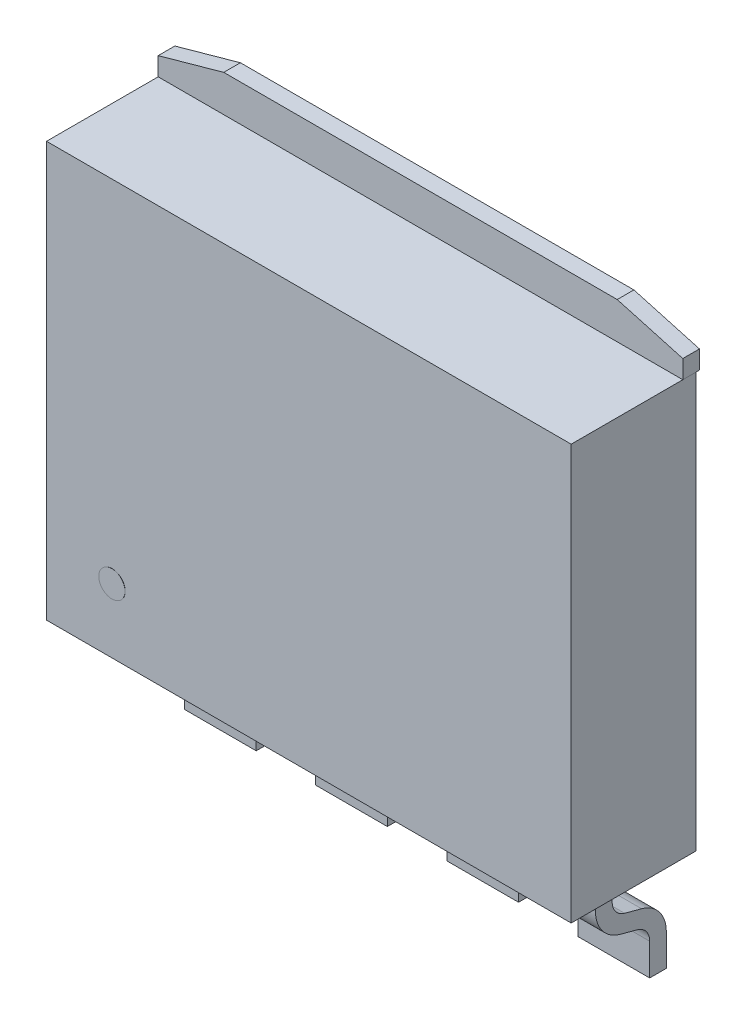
ISO-10303-21;
HEADER;
FILE_DESCRIPTION(('STEP AP214'),'2;1');
FILE_NAME('part.step','',(''),(''),'','','');
FILE_SCHEMA(('AUTOMOTIVE_DESIGN { 1 0 10303 214 1 1 1 1 }'));
ENDSEC;
DATA;
#1=APPLICATION_CONTEXT('core data for automotive mechanical design processes');
#2=APPLICATION_PROTOCOL_DEFINITION('international standard','automotive_design',2000,#1);
#3=PRODUCT_CONTEXT('',#1,'mechanical');
#4=PRODUCT('Part','Part','',(#3));
#5=PRODUCT_RELATED_PRODUCT_CATEGORY('part','',(#4));
#6=PRODUCT_DEFINITION_FORMATION('','',#4);
#7=PRODUCT_DEFINITION_CONTEXT('part definition',#1,'design');
#8=PRODUCT_DEFINITION('design','',#6,#7);
#9=PRODUCT_DEFINITION_SHAPE('','',#8);
#10=(LENGTH_UNIT() NAMED_UNIT(*) SI_UNIT(.MILLI.,.METRE.));
#11=(NAMED_UNIT(*) PLANE_ANGLE_UNIT() SI_UNIT($,.RADIAN.));
#12=(NAMED_UNIT(*) SI_UNIT($,.STERADIAN.) SOLID_ANGLE_UNIT());
#13=UNCERTAINTY_MEASURE_WITH_UNIT(LENGTH_MEASURE(1.E-05),#10,'distance_accuracy_value','');
#14=(GEOMETRIC_REPRESENTATION_CONTEXT(3) GLOBAL_UNCERTAINTY_ASSIGNED_CONTEXT((#13)) GLOBAL_UNIT_ASSIGNED_CONTEXT((#10,
#11,#12)) REPRESENTATION_CONTEXT('',''));
#15=CARTESIAN_POINT('',(0.,0.,0.));
#16=DIRECTION('',(0.,0.,1.));
#17=DIRECTION('',(1.,0.,0.));
#18=AXIS2_PLACEMENT_3D('',#15,#16,#17);
#19=CARTESIAN_POINT('',(-3.,-2.181,1.908));
#20=DIRECTION('',(0.,0.,1.));
#21=DIRECTION('',(1.,0.,0.));
#22=AXIS2_PLACEMENT_3D('',#19,#20,#21);
#23=PLANE('',#22);
#24=CARTESIAN_POINT('',(-3.,-2.181,1.908));
#25=DIRECTION('',(0.,0.,1.));
#26=DIRECTION('',(1.,0.,0.));
#27=AXIS2_PLACEMENT_3D('',#24,#25,#26);
#28=CIRCLE('',#27,0.200025);
#29=CARTESIAN_POINT('',(-3.2,-2.181,1.908));
#30=VERTEX_POINT('',#29);
#31=EDGE_CURVE('P0_E44',#30,#30,#28,.T.);
#32=ORIENTED_EDGE('',*,*,#31,.T.);
#33=EDGE_LOOP('',(#32));
#34=FACE_BOUND('',#33,.T.);
#35=ADVANCED_FACE('P0_F17',(#34),#23,.T.);
#36=CARTESIAN_POINT('',(-3.,-2.181,1.905));
#37=DIRECTION('',(0.,0.,1.));
#38=DIRECTION('',(1.,0.,0.));
#39=AXIS2_PLACEMENT_3D('',#36,#37,#38);
#40=PLANE('',#39);
#41=CARTESIAN_POINT('',(-3.,-2.181,1.905));
#42=DIRECTION('',(0.,0.,-1.));
#43=DIRECTION('',(1.,0.,0.));
#44=AXIS2_PLACEMENT_3D('',#41,#42,#43);
#45=CIRCLE('',#44,0.200025);
#46=CARTESIAN_POINT('',(-3.2,-2.181,1.905));
#47=VERTEX_POINT('',#46);
#48=EDGE_CURVE('P0_E11',#47,#47,#45,.T.);
#49=ORIENTED_EDGE('',*,*,#48,.T.);
#50=EDGE_LOOP('',(#49));
#51=FACE_BOUND('',#50,.T.);
#52=ADVANCED_FACE('P0_F69',(#51),#40,.F.);
#53=CARTESIAN_POINT('',(-3.,-2.181,1.905));
#54=DIRECTION('',(0.,0.,1.));
#55=DIRECTION('',(1.,0.,0.));
#56=AXIS2_PLACEMENT_3D('',#53,#54,#55);
#57=CYLINDRICAL_SURFACE('',#56,0.200025);
#58=ORIENTED_EDGE('',*,*,#31,.F.);
#59=CARTESIAN_POINT('',(-3.200025,-2.181,1.905));
#60=CARTESIAN_POINT('',(-3.200025,-2.181,1.908));
#61=(BOUNDED_CURVE() B_SPLINE_CURVE(1,(#59,#60),.UNSPECIFIED.,.F.,
.F.) B_SPLINE_CURVE_WITH_KNOTS((2,2),(0.,0.003),
.UNSPECIFIED.) CURVE() GEOMETRIC_REPRESENTATION_ITEM() RATIONAL_B_SPLINE_CURVE((1.,1.)) REPRESENTATION_ITEM(''));
#62=EDGE_CURVE('P0_E26',#47,#30,#61,.T.);
#63=ORIENTED_EDGE('',*,*,#62,.F.);
#64=ORIENTED_EDGE('',*,*,#48,.F.);
#65=ORIENTED_EDGE('',*,*,#62,.T.);
#66=EDGE_LOOP('',(#58,#63,#64,#65));
#67=FACE_BOUND('',#66,.T.);
#68=ADVANCED_FACE('P0_F43',(#67),#57,.T.);
#69=CLOSED_SHELL('',(#35,#52,#68));
#70=MANIFOLD_SOLID_BREP('P0_B1',#69);
#71=CARTESIAN_POINT('',(-4.,-3.162,1.905));
#72=DIRECTION('',(0.,0.,1.));
#73=DIRECTION('',(1.,0.,0.));
#74=AXIS2_PLACEMENT_3D('',#71,#72,#73);
#75=PLANE('',#74);
#76=DIRECTION('',(1.,0.,0.));
#77=VECTOR('',#76,1.);
#78=CARTESIAN_POINT('',(-4.,-3.162,1.905));
#79=LINE('',#78,#77);
#80=CARTESIAN_POINT('',(-4.,-3.162,1.905));
#81=VERTEX_POINT('',#80);
#82=CARTESIAN_POINT('',(4.,-3.162,1.905));
#83=VERTEX_POINT('',#82);
#84=EDGE_CURVE('P1_E86',#81,#83,#79,.T.);
#85=ORIENTED_EDGE('',*,*,#84,.T.);
#86=DIRECTION('',(0.,1.,0.));
#87=VECTOR('',#86,1.);
#88=CARTESIAN_POINT('',(4.,-3.162,1.905));
#89=LINE('',#88,#87);
#90=CARTESIAN_POINT('',(4.,3.162,1.905));
#91=VERTEX_POINT('',#90);
#92=EDGE_CURVE('P1_E81',#83,#91,#89,.T.);
#93=ORIENTED_EDGE('',*,*,#92,.T.);
#94=DIRECTION('',(-1.,0.,0.));
#95=VECTOR('',#94,1.);
#96=CARTESIAN_POINT('',(4.,3.162,1.905));
#97=LINE('',#96,#95);
#98=CARTESIAN_POINT('',(-4.,3.162,1.905));
#99=VERTEX_POINT('',#98);
#100=EDGE_CURVE('P1_E102',#91,#99,#97,.T.);
#101=ORIENTED_EDGE('',*,*,#100,.T.);
#102=DIRECTION('',(0.,-1.,0.));
#103=VECTOR('',#102,1.);
#104=CARTESIAN_POINT('',(-4.,3.162,1.905));
#105=LINE('',#104,#103);
#106=EDGE_CURVE('P1_E11',#99,#81,#105,.T.);
#107=ORIENTED_EDGE('',*,*,#106,.T.);
#108=EDGE_LOOP('',(#85,#93,#101,#107));
#109=FACE_BOUND('',#108,.T.);
#110=ADVANCED_FACE('P1_F17',(#109),#75,.T.);
#111=CARTESIAN_POINT('',(-4.,3.162,0.));
#112=DIRECTION('',(0.,0.,-1.));
#113=DIRECTION('',(0.,-1.,0.));
#114=AXIS2_PLACEMENT_3D('',#111,#112,#113);
#115=PLANE('',#114);
#116=DIRECTION('',(1.,0.,0.));
#117=VECTOR('',#116,1.);
#118=CARTESIAN_POINT('',(-4.,3.162,0.));
#119=LINE('',#118,#117);
#120=CARTESIAN_POINT('',(-4.,3.162,0.));
#121=VERTEX_POINT('',#120);
#122=CARTESIAN_POINT('',(4.,3.162,0.));
#123=VERTEX_POINT('',#122);
#124=EDGE_CURVE('P1_E69',#121,#123,#119,.T.);
#125=ORIENTED_EDGE('',*,*,#124,.T.);
#126=DIRECTION('',(0.,-1.,0.));
#127=VECTOR('',#126,1.);
#128=CARTESIAN_POINT('',(4.,3.162,0.));
#129=LINE('',#128,#127);
#130=CARTESIAN_POINT('',(4.,-3.162,0.));
#131=VERTEX_POINT('',#130);
#132=EDGE_CURVE('P1_E63',#123,#131,#129,.T.);
#133=ORIENTED_EDGE('',*,*,#132,.T.);
#134=DIRECTION('',(-1.,0.,0.));
#135=VECTOR('',#134,1.);
#136=CARTESIAN_POINT('',(4.,-3.162,0.));
#137=LINE('',#136,#135);
#138=CARTESIAN_POINT('',(-4.,-3.162,0.));
#139=VERTEX_POINT('',#138);
#140=EDGE_CURVE('P1_E67',#131,#139,#137,.T.);
#141=ORIENTED_EDGE('',*,*,#140,.T.);
#142=DIRECTION('',(0.,1.,0.));
#143=VECTOR('',#142,1.);
#144=CARTESIAN_POINT('',(-4.,-3.162,0.));
#145=LINE('',#144,#143);
#146=EDGE_CURVE('P1_E26',#139,#121,#145,.T.);
#147=ORIENTED_EDGE('',*,*,#146,.T.);
#148=EDGE_LOOP('',(#125,#133,#141,#147));
#149=FACE_BOUND('',#148,.T.);
#150=ADVANCED_FACE('P1_F65',(#149),#115,.T.);
#151=CARTESIAN_POINT('',(-4.,3.162,0.));
#152=DIRECTION('',(-1.,0.,0.));
#153=DIRECTION('',(0.,0.,1.));
#154=AXIS2_PLACEMENT_3D('',#151,#152,#153);
#155=PLANE('',#154);
#156=ORIENTED_EDGE('',*,*,#146,.F.);
#157=DIRECTION('',(0.,0.,1.));
#158=VECTOR('',#157,1.);
#159=CARTESIAN_POINT('',(-4.,-3.162,0.));
#160=LINE('',#159,#158);
#161=EDGE_CURVE('P1_E75',#139,#81,#160,.T.);
#162=ORIENTED_EDGE('',*,*,#161,.T.);
#163=ORIENTED_EDGE('',*,*,#106,.F.);
#164=DIRECTION('',(0.,0.,-1.));
#165=VECTOR('',#164,1.);
#166=CARTESIAN_POINT('',(-4.,3.162,1.905));
#167=LINE('',#166,#165);
#168=EDGE_CURVE('P1_E105',#99,#121,#167,.T.);
#169=ORIENTED_EDGE('',*,*,#168,.T.);
#170=EDGE_LOOP('',(#156,#162,#163,#169));
#171=FACE_BOUND('',#170,.T.);
#172=ADVANCED_FACE('P1_F112',(#171),#155,.T.);
#173=CARTESIAN_POINT('',(4.,3.162,0.));
#174=DIRECTION('',(0.,1.,0.));
#175=DIRECTION('',(1.,0.,0.));
#176=AXIS2_PLACEMENT_3D('',#173,#174,#175);
#177=PLANE('',#176);
#178=ORIENTED_EDGE('',*,*,#124,.F.);
#179=ORIENTED_EDGE('',*,*,#168,.F.);
#180=ORIENTED_EDGE('',*,*,#100,.F.);
#181=DIRECTION('',(0.,0.,-1.));
#182=VECTOR('',#181,1.);
#183=CARTESIAN_POINT('',(4.,3.162,1.905));
#184=LINE('',#183,#182);
#185=EDGE_CURVE('P1_E74',#91,#123,#184,.T.);
#186=ORIENTED_EDGE('',*,*,#185,.T.);
#187=EDGE_LOOP('',(#178,#179,#180,#186));
#188=FACE_BOUND('',#187,.T.);
#189=ADVANCED_FACE('P1_F115',(#188),#177,.T.);
#190=CARTESIAN_POINT('',(4.,-3.162,0.));
#191=DIRECTION('',(1.,0.,0.));
#192=DIRECTION('',(0.,1.,0.));
#193=AXIS2_PLACEMENT_3D('',#190,#191,#192);
#194=PLANE('',#193);
#195=ORIENTED_EDGE('',*,*,#132,.F.);
#196=ORIENTED_EDGE('',*,*,#185,.F.);
#197=ORIENTED_EDGE('',*,*,#92,.F.);
#198=DIRECTION('',(0.,0.,-1.));
#199=VECTOR('',#198,1.);
#200=CARTESIAN_POINT('',(4.,-3.162,1.905));
#201=LINE('',#200,#199);
#202=EDGE_CURVE('P1_E78',#83,#131,#201,.T.);
#203=ORIENTED_EDGE('',*,*,#202,.T.);
#204=EDGE_LOOP('',(#195,#196,#197,#203));
#205=FACE_BOUND('',#204,.T.);
#206=ADVANCED_FACE('P1_F79',(#205),#194,.T.);
#207=CARTESIAN_POINT('',(-4.,-3.162,0.));
#208=DIRECTION('',(0.,-1.,0.));
#209=DIRECTION('',(0.,0.,-1.));
#210=AXIS2_PLACEMENT_3D('',#207,#208,#209);
#211=PLANE('',#210);
#212=ORIENTED_EDGE('',*,*,#140,.F.);
#213=ORIENTED_EDGE('',*,*,#202,.F.);
#214=ORIENTED_EDGE('',*,*,#84,.F.);
#215=ORIENTED_EDGE('',*,*,#161,.F.);
#216=EDGE_LOOP('',(#212,#213,#214,#215));
#217=FACE_BOUND('',#216,.T.);
#218=ADVANCED_FACE('P1_F89',(#217),#211,.T.);
#219=CLOSED_SHELL('',(#110,#150,#172,#189,#206,#218));
#220=MANIFOLD_SOLID_BREP('P1_B1',#219);
#221=CARTESIAN_POINT('',(-0.19,-3.543,1.08));
#222=DIRECTION('',(0.,0.,1.));
#223=DIRECTION('',(1.,0.,0.));
#224=AXIS2_PLACEMENT_3D('',#221,#222,#223);
#225=PLANE('',#224);
#226=DIRECTION('',(1.,0.,0.));
#227=VECTOR('',#226,1.);
#228=CARTESIAN_POINT('',(-0.19,-3.543,1.08));
#229=LINE('',#228,#227);
#230=CARTESIAN_POINT('',(-0.19,-3.543,1.08));
#231=VERTEX_POINT('',#230);
#232=CARTESIAN_POINT('',(0.19,-3.543,1.08));
#233=VERTEX_POINT('',#232);
#234=EDGE_CURVE('P2_E95',#231,#233,#229,.T.);
#235=ORIENTED_EDGE('',*,*,#234,.T.);
#236=DIRECTION('',(0.,1.,0.));
#237=VECTOR('',#236,1.);
#238=CARTESIAN_POINT('',(0.19,-3.543,1.08));
#239=LINE('',#238,#237);
#240=CARTESIAN_POINT('',(0.19,-3.162,1.08));
#241=VERTEX_POINT('',#240);
#242=EDGE_CURVE('P2_E74',#233,#241,#239,.T.);
#243=ORIENTED_EDGE('',*,*,#242,.T.);
#244=DIRECTION('',(-1.,0.,0.));
#245=VECTOR('',#244,1.);
#246=CARTESIAN_POINT('',(0.19,-3.162,1.08));
#247=LINE('',#246,#245);
#248=CARTESIAN_POINT('',(-0.19,-3.162,1.08));
#249=VERTEX_POINT('',#248);
#250=EDGE_CURVE('P2_E21',#241,#249,#247,.T.);
#251=ORIENTED_EDGE('',*,*,#250,.T.);
#252=DIRECTION('',(0.,-1.,0.));
#253=VECTOR('',#252,1.);
#254=CARTESIAN_POINT('',(-0.19,-3.162,1.08));
#255=LINE('',#254,#253);
#256=EDGE_CURVE('P2_E11',#249,#231,#255,.T.);
#257=ORIENTED_EDGE('',*,*,#256,.T.);
#258=EDGE_LOOP('',(#235,#243,#251,#257));
#259=FACE_BOUND('',#258,.T.);
#260=ADVANCED_FACE('P2_F17',(#259),#225,.T.);
#261=CARTESIAN_POINT('',(-0.19,-3.162,0.826));
#262=DIRECTION('',(0.,0.,-1.));
#263=DIRECTION('',(0.,-1.,0.));
#264=AXIS2_PLACEMENT_3D('',#261,#262,#263);
#265=PLANE('',#264);
#266=DIRECTION('',(1.,0.,0.));
#267=VECTOR('',#266,1.);
#268=CARTESIAN_POINT('',(-0.19,-3.162,0.826));
#269=LINE('',#268,#267);
#270=CARTESIAN_POINT('',(-0.19,-3.162,0.826));
#271=VERTEX_POINT('',#270);
#272=CARTESIAN_POINT('',(0.19,-3.162,0.826));
#273=VERTEX_POINT('',#272);
#274=EDGE_CURVE('P2_E59',#271,#273,#269,.T.);
#275=ORIENTED_EDGE('',*,*,#274,.T.);
#276=DIRECTION('',(0.,-1.,0.));
#277=VECTOR('',#276,1.);
#278=CARTESIAN_POINT('',(0.19,-3.162,0.826));
#279=LINE('',#278,#277);
#280=CARTESIAN_POINT('',(0.19,-3.543,0.826));
#281=VERTEX_POINT('',#280);
#282=EDGE_CURVE('P2_E82',#273,#281,#279,.T.);
#283=ORIENTED_EDGE('',*,*,#282,.T.);
#284=DIRECTION('',(-1.,0.,0.));
#285=VECTOR('',#284,1.);
#286=CARTESIAN_POINT('',(0.19,-3.543,0.826));
#287=LINE('',#286,#285);
#288=CARTESIAN_POINT('',(-0.19,-3.543,0.826));
#289=VERTEX_POINT('',#288);
#290=EDGE_CURVE('P2_E84',#281,#289,#287,.T.);
#291=ORIENTED_EDGE('',*,*,#290,.T.);
#292=DIRECTION('',(0.,1.,0.));
#293=VECTOR('',#292,1.);
#294=CARTESIAN_POINT('',(-0.19,-3.543,0.826));
#295=LINE('',#294,#293);
#296=EDGE_CURVE('P2_E27',#289,#271,#295,.T.);
#297=ORIENTED_EDGE('',*,*,#296,.T.);
#298=EDGE_LOOP('',(#275,#283,#291,#297));
#299=FACE_BOUND('',#298,.T.);
#300=ADVANCED_FACE('P2_F19',(#299),#265,.T.);
#301=CARTESIAN_POINT('',(-0.19,-3.162,0.826));
#302=DIRECTION('',(-1.,0.,0.));
#303=DIRECTION('',(0.,0.,1.));
#304=AXIS2_PLACEMENT_3D('',#301,#302,#303);
#305=PLANE('',#304);
#306=ORIENTED_EDGE('',*,*,#296,.F.);
#307=DIRECTION('',(0.,0.,1.));
#308=VECTOR('',#307,1.);
#309=CARTESIAN_POINT('',(-0.19,-3.543,0.826));
#310=LINE('',#309,#308);
#311=EDGE_CURVE('P2_E87',#289,#231,#310,.T.);
#312=ORIENTED_EDGE('',*,*,#311,.T.);
#313=ORIENTED_EDGE('',*,*,#256,.F.);
#314=DIRECTION('',(0.,0.,-1.));
#315=VECTOR('',#314,1.);
#316=CARTESIAN_POINT('',(-0.19,-3.162,1.08));
#317=LINE('',#316,#315);
#318=EDGE_CURVE('P2_E108',#249,#271,#317,.T.);
#319=ORIENTED_EDGE('',*,*,#318,.T.);
#320=EDGE_LOOP('',(#306,#312,#313,#319));
#321=FACE_BOUND('',#320,.T.);
#322=ADVANCED_FACE('P2_F159',(#321),#305,.T.);
#323=CARTESIAN_POINT('',(0.19,-3.162,0.826));
#324=DIRECTION('',(0.,1.,0.));
#325=DIRECTION('',(1.,0.,0.));
#326=AXIS2_PLACEMENT_3D('',#323,#324,#325);
#327=PLANE('',#326);
#328=ORIENTED_EDGE('',*,*,#274,.F.);
#329=ORIENTED_EDGE('',*,*,#318,.F.);
#330=ORIENTED_EDGE('',*,*,#250,.F.);
#331=DIRECTION('',(0.,0.,-1.));
#332=VECTOR('',#331,1.);
#333=CARTESIAN_POINT('',(0.19,-3.162,1.08));
#334=LINE('',#333,#332);
#335=EDGE_CURVE('P2_E86',#241,#273,#334,.T.);
#336=ORIENTED_EDGE('',*,*,#335,.T.);
#337=EDGE_LOOP('',(#328,#329,#330,#336));
#338=FACE_BOUND('',#337,.T.);
#339=ADVANCED_FACE('P2_F149',(#338),#327,.T.);
#340=CARTESIAN_POINT('',(0.19,-3.543,0.826));
#341=DIRECTION('',(1.,0.,0.));
#342=DIRECTION('',(0.,1.,0.));
#343=AXIS2_PLACEMENT_3D('',#340,#341,#342);
#344=PLANE('',#343);
#345=ORIENTED_EDGE('',*,*,#282,.F.);
#346=ORIENTED_EDGE('',*,*,#335,.F.);
#347=ORIENTED_EDGE('',*,*,#242,.F.);
#348=DIRECTION('',(0.,0.,-1.));
#349=VECTOR('',#348,1.);
#350=CARTESIAN_POINT('',(0.19,-3.543,1.08));
#351=LINE('',#350,#349);
#352=EDGE_CURVE('P2_E90',#233,#281,#351,.T.);
#353=ORIENTED_EDGE('',*,*,#352,.T.);
#354=EDGE_LOOP('',(#345,#346,#347,#353));
#355=FACE_BOUND('',#354,.T.);
#356=ADVANCED_FACE('P2_F91',(#355),#344,.T.);
#357=CARTESIAN_POINT('',(-0.19,-3.543,0.826));
#358=DIRECTION('',(0.,-1.,0.));
#359=DIRECTION('',(0.,0.,-1.));
#360=AXIS2_PLACEMENT_3D('',#357,#358,#359);
#361=PLANE('',#360);
#362=ORIENTED_EDGE('',*,*,#290,.F.);
#363=ORIENTED_EDGE('',*,*,#352,.F.);
#364=ORIENTED_EDGE('',*,*,#234,.F.);
#365=ORIENTED_EDGE('',*,*,#311,.F.);
#366=EDGE_LOOP('',(#362,#363,#364,#365));
#367=FACE_BOUND('',#366,.T.);
#368=ADVANCED_FACE('P2_F98',(#367),#361,.T.);
#369=CLOSED_SHELL('',(#260,#300,#322,#339,#356,#368));
#370=MANIFOLD_SOLID_BREP('P2_B1',#369);
#371=CARTESIAN_POINT('',(-2.454,-4.454,0.254));
#372=DIRECTION('',(1.,0.,0.));
#373=DIRECTION('',(0.,1.,0.));
#374=AXIS2_PLACEMENT_3D('',#371,#372,#373);
#375=PLANE('',#374);
#376=DIRECTION('',(0.,1.,0.));
#377=VECTOR('',#376,1.);
#378=CARTESIAN_POINT('',(-2.454,-3.648,0.826));
#379=LINE('',#378,#377);
#380=CARTESIAN_POINT('',(-2.454,-3.648,0.826));
#381=VERTEX_POINT('',#380);
#382=CARTESIAN_POINT('',(-2.454,-3.162,0.826));
#383=VERTEX_POINT('',#382);
#384=EDGE_CURVE('P3_E318',#381,#383,#379,.T.);
#385=ORIENTED_EDGE('',*,*,#384,.T.);
#386=DIRECTION('',(0.,0.,1.));
#387=VECTOR('',#386,1.);
#388=CARTESIAN_POINT('',(-2.454,-3.162,0.826));
#389=LINE('',#388,#387);
#390=CARTESIAN_POINT('',(-2.454,-3.162,1.08));
#391=VERTEX_POINT('',#390);
#392=EDGE_CURVE('P3_E328',#383,#391,#389,.T.);
#393=ORIENTED_EDGE('',*,*,#392,.T.);
#394=DIRECTION('',(0.,-1.,0.));
#395=VECTOR('',#394,1.);
#396=CARTESIAN_POINT('',(-2.454,-3.162,1.08));
#397=LINE('',#396,#395);
#398=CARTESIAN_POINT('',(-2.454,-3.648,1.08));
#399=VERTEX_POINT('',#398);
#400=EDGE_CURVE('P3_E319',#391,#399,#397,.T.);
#401=ORIENTED_EDGE('',*,*,#400,.T.);
#402=CARTESIAN_POINT('',(-2.454,-3.648,0.572));
#403=DIRECTION('',(1.,0.,0.));
#404=DIRECTION('',(0.,-0.793107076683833,-0.609082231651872));
#405=AXIS2_PLACEMENT_3D('',#402,#403,#404);
#406=CIRCLE('',#405,0.508);
#407=CARTESIAN_POINT('',(-2.454,-4.139,0.703));
#408=VERTEX_POINT('',#407);
#409=EDGE_CURVE('P3_E248',#399,#408,#406,.T.);
#410=ORIENTED_EDGE('',*,*,#409,.T.);
#411=CARTESIAN_POINT('',(-2.454,-4.139,0.703));
#412=DIRECTION('',(0.,-0.258969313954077,-0.965885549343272));
#413=VECTOR('',#412,1.);
#414=LINE('',#411,#413);
#415=CARTESIAN_POINT('',(-2.454,-4.209,0.442));
#416=VERTEX_POINT('',#415);
#417=EDGE_CURVE('P3_E357',#408,#416,#414,.T.);
#418=ORIENTED_EDGE('',*,*,#417,.T.);
#419=CARTESIAN_POINT('',(-2.454,-4.454,0.508));
#420=DIRECTION('',(-1.,0.,0.));
#421=DIRECTION('',(0.,-0.793107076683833,-0.609082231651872));
#422=AXIS2_PLACEMENT_3D('',#419,#420,#421);
#423=CIRCLE('',#422,0.254);
#424=CARTESIAN_POINT('',(-2.454,-4.454,0.254));
#425=VERTEX_POINT('',#424);
#426=EDGE_CURVE('P3_E263',#416,#425,#423,.T.);
#427=ORIENTED_EDGE('',*,*,#426,.T.);
#428=DIRECTION('',(0.,-1.,0.));
#429=VECTOR('',#428,1.);
#430=CARTESIAN_POINT('',(-2.454,-4.454,0.254));
#431=LINE('',#430,#429);
#432=CARTESIAN_POINT('',(-2.454,-4.94,0.254));
#433=VERTEX_POINT('',#432);
#434=EDGE_CURVE('P3_E308',#425,#433,#431,.T.);
#435=ORIENTED_EDGE('',*,*,#434,.T.);
#436=DIRECTION('',(0.,0.,-1.));
#437=VECTOR('',#436,1.);
#438=CARTESIAN_POINT('',(-2.454,-4.94,0.254));
#439=LINE('',#438,#437);
#440=CARTESIAN_POINT('',(-2.454,-4.94,0.));
#441=VERTEX_POINT('',#440);
#442=EDGE_CURVE('P3_E53',#433,#441,#439,.T.);
#443=ORIENTED_EDGE('',*,*,#442,.T.);
#444=DIRECTION('',(0.,1.,0.));
#445=VECTOR('',#444,1.);
#446=CARTESIAN_POINT('',(-2.454,-4.94,0.));
#447=LINE('',#446,#445);
#448=CARTESIAN_POINT('',(-2.454,-4.454,0.));
#449=VERTEX_POINT('',#448);
#450=EDGE_CURVE('P3_E144',#441,#449,#447,.T.);
#451=ORIENTED_EDGE('',*,*,#450,.T.);
#452=CARTESIAN_POINT('',(-2.454,-4.454,0.508));
#453=DIRECTION('',(1.,0.,0.));
#454=DIRECTION('',(0.,0.793107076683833,0.609082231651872));
#455=AXIS2_PLACEMENT_3D('',#452,#453,#454);
#456=CIRCLE('',#455,0.508);
#457=CARTESIAN_POINT('',(-2.454,-3.964,0.377));
#458=VERTEX_POINT('',#457);
#459=EDGE_CURVE('P3_E11',#449,#458,#456,.T.);
#460=ORIENTED_EDGE('',*,*,#459,.T.);
#461=DIRECTION('',(0.,0.258969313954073,0.965885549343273));
#462=VECTOR('',#461,1.);
#463=CARTESIAN_POINT('',(-2.454,-3.964,0.377));
#464=LINE('',#463,#462);
#465=CARTESIAN_POINT('',(-2.454,-3.894,0.637));
#466=VERTEX_POINT('',#465);
#467=EDGE_CURVE('P3_E141',#458,#466,#464,.T.);
#468=ORIENTED_EDGE('',*,*,#467,.T.);
#469=CARTESIAN_POINT('',(-2.454,-3.648,0.572));
#470=DIRECTION('',(-1.,0.,0.));
#471=DIRECTION('',(0.,0.793107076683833,0.609082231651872));
#472=AXIS2_PLACEMENT_3D('',#469,#470,#471);
#473=CIRCLE('',#472,0.254);
#474=EDGE_CURVE('P3_E253',#466,#381,#473,.T.);
#475=ORIENTED_EDGE('',*,*,#474,.T.);
#476=EDGE_LOOP('',(#385,#393,#401,#410,#418,#427,#435,#443,#451,#460,#468,#475));
#477=FACE_BOUND('',#476,.T.);
#478=ADVANCED_FACE('P3_F17',(#477),#375,.T.);
#479=CARTESIAN_POINT('',(-3.546,-3.162,0.826));
#480=DIRECTION('',(-1.,0.,0.));
#481=DIRECTION('',(0.,0.,1.));
#482=AXIS2_PLACEMENT_3D('',#479,#480,#481);
#483=PLANE('',#482);
#484=DIRECTION('',(0.,1.,0.));
#485=VECTOR('',#484,1.);
#486=CARTESIAN_POINT('',(-3.546,-3.648,1.08));
#487=LINE('',#486,#485);
#488=CARTESIAN_POINT('',(-3.546,-3.648,1.08));
#489=VERTEX_POINT('',#488);
#490=CARTESIAN_POINT('',(-3.546,-3.162,1.08));
#491=VERTEX_POINT('',#490);
#492=EDGE_CURVE('P3_E327',#489,#491,#487,.T.);
#493=ORIENTED_EDGE('',*,*,#492,.T.);
#494=DIRECTION('',(0.,0.,-1.));
#495=VECTOR('',#494,1.);
#496=CARTESIAN_POINT('',(-3.546,-3.162,1.08));
#497=LINE('',#496,#495);
#498=CARTESIAN_POINT('',(-3.546,-3.162,0.826));
#499=VERTEX_POINT('',#498);
#500=EDGE_CURVE('P3_E338',#491,#499,#497,.T.);
#501=ORIENTED_EDGE('',*,*,#500,.T.);
#502=DIRECTION('',(0.,-1.,0.));
#503=VECTOR('',#502,1.);
#504=CARTESIAN_POINT('',(-3.546,-3.162,0.826));
#505=LINE('',#504,#503);
#506=CARTESIAN_POINT('',(-3.546,-3.648,0.826));
#507=VERTEX_POINT('',#506);
#508=EDGE_CURVE('P3_E317',#499,#507,#505,.T.);
#509=ORIENTED_EDGE('',*,*,#508,.T.);
#510=CARTESIAN_POINT('',(-3.546,-3.648,0.572));
#511=DIRECTION('',(1.,0.,0.));
#512=DIRECTION('',(0.,-0.793107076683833,-0.609082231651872));
#513=AXIS2_PLACEMENT_3D('',#510,#511,#512);
#514=CIRCLE('',#513,0.254);
#515=CARTESIAN_POINT('',(-3.546,-3.894,0.637));
#516=VERTEX_POINT('',#515);
#517=EDGE_CURVE('P3_E258',#507,#516,#514,.T.);
#518=ORIENTED_EDGE('',*,*,#517,.T.);
#519=CARTESIAN_POINT('',(-3.546,-3.894,0.637));
#520=DIRECTION('',(0.,-0.258969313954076,-0.965885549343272));
#521=VECTOR('',#520,1.);
#522=LINE('',#519,#521);
#523=CARTESIAN_POINT('',(-3.546,-3.964,0.377));
#524=VERTEX_POINT('',#523);
#525=EDGE_CURVE('P3_E164',#516,#524,#522,.T.);
#526=ORIENTED_EDGE('',*,*,#525,.T.);
#527=CARTESIAN_POINT('',(-3.546,-4.454,0.508));
#528=DIRECTION('',(-1.,0.,0.));
#529=DIRECTION('',(0.,-0.793107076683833,-0.609082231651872));
#530=AXIS2_PLACEMENT_3D('',#527,#528,#529);
#531=CIRCLE('',#530,0.508);
#532=CARTESIAN_POINT('',(-3.546,-4.454,0.));
#533=VERTEX_POINT('',#532);
#534=EDGE_CURVE('P3_E30',#524,#533,#531,.T.);
#535=ORIENTED_EDGE('',*,*,#534,.T.);
#536=DIRECTION('',(0.,-1.,0.));
#537=VECTOR('',#536,1.);
#538=CARTESIAN_POINT('',(-3.546,-4.454,0.));
#539=LINE('',#538,#537);
#540=CARTESIAN_POINT('',(-3.546,-4.94,0.));
#541=VERTEX_POINT('',#540);
#542=EDGE_CURVE('P3_E291',#533,#541,#539,.T.);
#543=ORIENTED_EDGE('',*,*,#542,.T.);
#544=DIRECTION('',(0.,0.,1.));
#545=VECTOR('',#544,1.);
#546=CARTESIAN_POINT('',(-3.546,-4.94,0.));
#547=LINE('',#546,#545);
#548=CARTESIAN_POINT('',(-3.546,-4.94,0.254));
#549=VERTEX_POINT('',#548);
#550=EDGE_CURVE('P3_E43',#541,#549,#547,.T.);
#551=ORIENTED_EDGE('',*,*,#550,.T.);
#552=DIRECTION('',(0.,1.,0.));
#553=VECTOR('',#552,1.);
#554=CARTESIAN_POINT('',(-3.546,-4.94,0.254));
#555=LINE('',#554,#553);
#556=CARTESIAN_POINT('',(-3.546,-4.454,0.254));
#557=VERTEX_POINT('',#556);
#558=EDGE_CURVE('P3_E300',#549,#557,#555,.T.);
#559=ORIENTED_EDGE('',*,*,#558,.T.);
#560=CARTESIAN_POINT('',(-3.546,-4.454,0.508));
#561=DIRECTION('',(1.,0.,0.));
#562=DIRECTION('',(0.,0.793107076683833,0.609082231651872));
#563=AXIS2_PLACEMENT_3D('',#560,#561,#562);
#564=CIRCLE('',#563,0.254);
#565=CARTESIAN_POINT('',(-3.546,-4.209,0.442));
#566=VERTEX_POINT('',#565);
#567=EDGE_CURVE('P3_E268',#557,#566,#564,.T.);
#568=ORIENTED_EDGE('',*,*,#567,.T.);
#569=DIRECTION('',(0.,0.258969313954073,0.965885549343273));
#570=VECTOR('',#569,1.);
#571=CARTESIAN_POINT('',(-3.546,-4.209,0.442));
#572=LINE('',#571,#570);
#573=CARTESIAN_POINT('',(-3.546,-4.139,0.703));
#574=VERTEX_POINT('',#573);
#575=EDGE_CURVE('P3_E165',#566,#574,#572,.T.);
#576=ORIENTED_EDGE('',*,*,#575,.T.);
#577=CARTESIAN_POINT('',(-3.546,-3.648,0.572));
#578=DIRECTION('',(-1.,0.,0.));
#579=DIRECTION('',(0.,0.793107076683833,0.609082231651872));
#580=AXIS2_PLACEMENT_3D('',#577,#578,#579);
#581=CIRCLE('',#580,0.508);
#582=EDGE_CURVE('P3_E245',#574,#489,#581,.T.);
#583=ORIENTED_EDGE('',*,*,#582,.T.);
#584=EDGE_LOOP('',(#493,#501,#509,#518,#526,#535,#543,#551,#559,#568,#576,#583));
#585=FACE_BOUND('',#584,.T.);
#586=ADVANCED_FACE('P3_F217',(#585),#483,.T.);
#587=CARTESIAN_POINT('',(-3.546,-4.454,0.508));
#588=DIRECTION('',(1.,0.,0.));
#589=DIRECTION('',(0.,0.,-1.));
#590=AXIS2_PLACEMENT_3D('',#587,#588,#589);
#591=CYLINDRICAL_SURFACE('',#590,0.508);
#592=DIRECTION('',(-1.,0.,0.));
#593=VECTOR('',#592,1.);
#594=CARTESIAN_POINT('',(-2.454,-4.454,0.));
#595=LINE('',#594,#593);
#596=EDGE_CURVE('P3_E297',#449,#533,#595,.T.);
#597=ORIENTED_EDGE('',*,*,#596,.T.);
#598=ORIENTED_EDGE('',*,*,#534,.F.);
#599=CARTESIAN_POINT('',(-3.546,-3.96323586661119,0.376795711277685));
#600=DIRECTION('',(1.,0.,0.));
#601=VECTOR('',#600,1.);
#602=LINE('',#599,#601);
#603=EDGE_CURVE('P3_E153',#524,#458,#602,.T.);
#604=ORIENTED_EDGE('',*,*,#603,.T.);
#605=ORIENTED_EDGE('',*,*,#459,.F.);
#606=EDGE_LOOP('',(#597,#598,#604,#605));
#607=FACE_BOUND('',#606,.T.);
#608=ADVANCED_FACE('P3_F19',(#607),#591,.T.);
#609=CARTESIAN_POINT('',(-3.546,-4.454,0.508));
#610=DIRECTION('',(1.,0.,0.));
#611=DIRECTION('',(0.,0.,1.));
#612=AXIS2_PLACEMENT_3D('',#609,#610,#611);
#613=CYLINDRICAL_SURFACE('',#612,0.254);
#614=DIRECTION('',(1.,0.,0.));
#615=VECTOR('',#614,1.);
#616=CARTESIAN_POINT('',(-3.546,-4.454,0.254));
#617=LINE('',#616,#615);
#618=EDGE_CURVE('P3_E304',#557,#425,#617,.T.);
#619=ORIENTED_EDGE('',*,*,#618,.T.);
#620=ORIENTED_EDGE('',*,*,#426,.F.);
#621=CARTESIAN_POINT('',(-2.454,-4.2087432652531,0.441930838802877));
#622=DIRECTION('',(-1.,0.,0.));
#623=VECTOR('',#622,1.);
#624=LINE('',#621,#623);
#625=EDGE_CURVE('P3_E352',#416,#566,#624,.T.);
#626=ORIENTED_EDGE('',*,*,#625,.T.);
#627=ORIENTED_EDGE('',*,*,#567,.F.);
#628=EDGE_LOOP('',(#619,#620,#626,#627));
#629=FACE_BOUND('',#628,.T.);
#630=ADVANCED_FACE('P3_F231',(#629),#613,.F.);
#631=CARTESIAN_POINT('',(-3.546,-3.648,0.572));
#632=DIRECTION('',(1.,0.,0.));
#633=DIRECTION('',(0.,0.,-1.));
#634=AXIS2_PLACEMENT_3D('',#631,#632,#633);
#635=CYLINDRICAL_SURFACE('',#634,0.254);
#636=DIRECTION('',(1.,0.,0.));
#637=VECTOR('',#636,1.);
#638=CARTESIAN_POINT('',(-3.546,-3.648,0.826));
#639=LINE('',#638,#637);
#640=EDGE_CURVE('P3_E313',#507,#381,#639,.T.);
#641=ORIENTED_EDGE('',*,*,#640,.T.);
#642=ORIENTED_EDGE('',*,*,#474,.F.);
#643=CARTESIAN_POINT('',(-2.454,-3.89357215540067,0.63688695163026));
#644=DIRECTION('',(-1.,0.,0.));
#645=VECTOR('',#644,1.);
#646=LINE('',#643,#645);
#647=EDGE_CURVE('P3_E156',#466,#516,#646,.T.);
#648=ORIENTED_EDGE('',*,*,#647,.T.);
#649=ORIENTED_EDGE('',*,*,#517,.F.);
#650=EDGE_LOOP('',(#641,#642,#648,#649));
#651=FACE_BOUND('',#650,.T.);
#652=ADVANCED_FACE('P3_F227',(#651),#635,.F.);
#653=CARTESIAN_POINT('',(-2.454,-3.648,0.572));
#654=DIRECTION('',(1.,0.,0.));
#655=DIRECTION('',(0.,0.,1.));
#656=AXIS2_PLACEMENT_3D('',#653,#654,#655);
#657=CYLINDRICAL_SURFACE('',#656,0.508);
#658=DIRECTION('',(-1.,0.,0.));
#659=VECTOR('',#658,1.);
#660=CARTESIAN_POINT('',(-2.454,-3.648,1.08));
#661=LINE('',#660,#659);
#662=EDGE_CURVE('P3_E323',#399,#489,#661,.T.);
#663=ORIENTED_EDGE('',*,*,#662,.T.);
#664=ORIENTED_EDGE('',*,*,#582,.F.);
#665=CARTESIAN_POINT('',(-3.546,-4.13883075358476,0.702954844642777));
#666=DIRECTION('',(1.,0.,0.));
#667=VECTOR('',#666,1.);
#668=LINE('',#665,#667);
#669=EDGE_CURVE('P3_E274',#574,#408,#668,.T.);
#670=ORIENTED_EDGE('',*,*,#669,.T.);
#671=ORIENTED_EDGE('',*,*,#409,.F.);
#672=EDGE_LOOP('',(#663,#664,#670,#671));
#673=FACE_BOUND('',#672,.T.);
#674=ADVANCED_FACE('P3_F230',(#673),#657,.T.);
#675=CARTESIAN_POINT('',(-3.546,-4.94,0.));
#676=DIRECTION('',(0.,-1.,0.));
#677=DIRECTION('',(0.,0.,-1.));
#678=AXIS2_PLACEMENT_3D('',#675,#676,#677);
#679=PLANE('',#678);
#680=DIRECTION('',(1.,0.,0.));
#681=VECTOR('',#680,1.);
#682=CARTESIAN_POINT('',(-3.546,-4.94,0.));
#683=LINE('',#682,#681);
#684=EDGE_CURVE('P3_E292',#541,#441,#683,.T.);
#685=ORIENTED_EDGE('',*,*,#684,.T.);
#686=ORIENTED_EDGE('',*,*,#442,.F.);
#687=DIRECTION('',(-1.,0.,0.));
#688=VECTOR('',#687,1.);
#689=CARTESIAN_POINT('',(-2.454,-4.94,0.254));
#690=LINE('',#689,#688);
#691=EDGE_CURVE('P3_E159',#433,#549,#690,.T.);
#692=ORIENTED_EDGE('',*,*,#691,.T.);
#693=ORIENTED_EDGE('',*,*,#550,.F.);
#694=EDGE_LOOP('',(#685,#686,#692,#693));
#695=FACE_BOUND('',#694,.T.);
#696=ADVANCED_FACE('P3_F196',(#695),#679,.T.);
#697=CARTESIAN_POINT('',(-3.546,-4.454,0.));
#698=DIRECTION('',(0.,0.,-1.));
#699=DIRECTION('',(0.,-1.,0.));
#700=AXIS2_PLACEMENT_3D('',#697,#698,#699);
#701=PLANE('',#700);
#702=ORIENTED_EDGE('',*,*,#596,.F.);
#703=ORIENTED_EDGE('',*,*,#450,.F.);
#704=ORIENTED_EDGE('',*,*,#684,.F.);
#705=ORIENTED_EDGE('',*,*,#542,.F.);
#706=EDGE_LOOP('',(#702,#703,#704,#705));
#707=FACE_BOUND('',#706,.T.);
#708=ADVANCED_FACE('P3_F390',(#707),#701,.T.);
#709=CARTESIAN_POINT('',(-3.546,-4.94,0.254));
#710=DIRECTION('',(0.,0.,1.));
#711=DIRECTION('',(1.,0.,0.));
#712=AXIS2_PLACEMENT_3D('',#709,#710,#711);
#713=PLANE('',#712);
#714=ORIENTED_EDGE('',*,*,#691,.F.);
#715=ORIENTED_EDGE('',*,*,#434,.F.);
#716=ORIENTED_EDGE('',*,*,#618,.F.);
#717=ORIENTED_EDGE('',*,*,#558,.F.);
#718=EDGE_LOOP('',(#714,#715,#716,#717));
#719=FACE_BOUND('',#718,.T.);
#720=ADVANCED_FACE('P3_F195',(#719),#713,.T.);
#721=CARTESIAN_POINT('',(-2.454,-3.964,0.377));
#722=DIRECTION('',(0.,0.965885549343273,-0.258969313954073));
#723=DIRECTION('',(-1.,0.,0.));
#724=AXIS2_PLACEMENT_3D('',#721,#722,#723);
#725=PLANE('',#724);
#726=ORIENTED_EDGE('',*,*,#603,.F.);
#727=ORIENTED_EDGE('',*,*,#525,.F.);
#728=ORIENTED_EDGE('',*,*,#647,.F.);
#729=ORIENTED_EDGE('',*,*,#467,.F.);
#730=EDGE_LOOP('',(#726,#727,#728,#729));
#731=FACE_BOUND('',#730,.T.);
#732=ADVANCED_FACE('P3_F151',(#731),#725,.T.);
#733=CARTESIAN_POINT('',(-3.546,-4.209,0.442));
#734=DIRECTION('',(0.,-0.965885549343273,0.258969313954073));
#735=DIRECTION('',(-1.,0.,0.));
#736=AXIS2_PLACEMENT_3D('',#733,#734,#735);
#737=PLANE('',#736);
#738=ORIENTED_EDGE('',*,*,#625,.F.);
#739=ORIENTED_EDGE('',*,*,#417,.F.);
#740=ORIENTED_EDGE('',*,*,#669,.F.);
#741=ORIENTED_EDGE('',*,*,#575,.F.);
#742=EDGE_LOOP('',(#738,#739,#740,#741));
#743=FACE_BOUND('',#742,.T.);
#744=ADVANCED_FACE('P3_F194',(#743),#737,.T.);
#745=CARTESIAN_POINT('',(-3.546,-3.162,0.826));
#746=DIRECTION('',(0.,0.,-1.));
#747=DIRECTION('',(0.,-1.,0.));
#748=AXIS2_PLACEMENT_3D('',#745,#746,#747);
#749=PLANE('',#748);
#750=DIRECTION('',(1.,0.,0.));
#751=VECTOR('',#750,1.);
#752=CARTESIAN_POINT('',(-3.546,-3.162,0.826));
#753=LINE('',#752,#751);
#754=EDGE_CURVE('P3_E344',#499,#383,#753,.T.);
#755=ORIENTED_EDGE('',*,*,#754,.T.);
#756=ORIENTED_EDGE('',*,*,#384,.F.);
#757=ORIENTED_EDGE('',*,*,#640,.F.);
#758=ORIENTED_EDGE('',*,*,#508,.F.);
#759=EDGE_LOOP('',(#755,#756,#757,#758));
#760=FACE_BOUND('',#759,.T.);
#761=ADVANCED_FACE('P3_F198',(#760),#749,.T.);
#762=CARTESIAN_POINT('',(-2.454,-3.162,1.08));
#763=DIRECTION('',(0.,0.,1.));
#764=DIRECTION('',(1.,0.,0.));
#765=AXIS2_PLACEMENT_3D('',#762,#763,#764);
#766=PLANE('',#765);
#767=DIRECTION('',(-1.,0.,0.));
#768=VECTOR('',#767,1.);
#769=CARTESIAN_POINT('',(-2.454,-3.162,1.08));
#770=LINE('',#769,#768);
#771=EDGE_CURVE('P3_E332',#391,#491,#770,.T.);
#772=ORIENTED_EDGE('',*,*,#771,.T.);
#773=ORIENTED_EDGE('',*,*,#492,.F.);
#774=ORIENTED_EDGE('',*,*,#662,.F.);
#775=ORIENTED_EDGE('',*,*,#400,.F.);
#776=EDGE_LOOP('',(#772,#773,#774,#775));
#777=FACE_BOUND('',#776,.T.);
#778=ADVANCED_FACE('P3_F413',(#777),#766,.T.);
#779=CARTESIAN_POINT('',(-2.454,-3.162,0.826));
#780=DIRECTION('',(0.,1.,0.));
#781=DIRECTION('',(1.,0.,0.));
#782=AXIS2_PLACEMENT_3D('',#779,#780,#781);
#783=PLANE('',#782);
#784=ORIENTED_EDGE('',*,*,#754,.F.);
#785=ORIENTED_EDGE('',*,*,#500,.F.);
#786=ORIENTED_EDGE('',*,*,#771,.F.);
#787=ORIENTED_EDGE('',*,*,#392,.F.);
#788=EDGE_LOOP('',(#784,#785,#786,#787));
#789=FACE_BOUND('',#788,.T.);
#790=ADVANCED_FACE('P3_F415',(#789),#783,.T.);
#791=CLOSED_SHELL('',(#478,#586,#608,#630,#652,#674,#696,#708,#720,#732,#744,#761,#778,#790));
#792=MANIFOLD_SOLID_BREP('P3_B1',#791);
#793=CARTESIAN_POINT('',(-0.454,-4.454,0.254));
#794=DIRECTION('',(1.,0.,0.));
#795=DIRECTION('',(0.,1.,0.));
#796=AXIS2_PLACEMENT_3D('',#793,#794,#795);
#797=PLANE('',#796);
#798=DIRECTION('',(0.,1.,0.));
#799=VECTOR('',#798,1.);
#800=CARTESIAN_POINT('',(-0.454,-3.648,0.826));
#801=LINE('',#800,#799);
#802=CARTESIAN_POINT('',(-0.454,-3.648,0.826));
#803=VERTEX_POINT('',#802);
#804=CARTESIAN_POINT('',(-0.454,-3.162,0.826));
#805=VERTEX_POINT('',#804);
#806=EDGE_CURVE('P4_E263',#803,#805,#801,.T.);
#807=ORIENTED_EDGE('',*,*,#806,.T.);
#808=DIRECTION('',(0.,0.,1.));
#809=VECTOR('',#808,1.);
#810=CARTESIAN_POINT('',(-0.454,-3.162,0.826));
#811=LINE('',#810,#809);
#812=CARTESIAN_POINT('',(-0.454,-3.162,1.08));
#813=VERTEX_POINT('',#812);
#814=EDGE_CURVE('P4_E414',#805,#813,#811,.T.);
#815=ORIENTED_EDGE('',*,*,#814,.T.);
#816=DIRECTION('',(0.,-1.,0.));
#817=VECTOR('',#816,1.);
#818=CARTESIAN_POINT('',(-0.454,-3.162,1.08));
#819=LINE('',#818,#817);
#820=CARTESIAN_POINT('',(-0.454,-3.648,1.08));
#821=VERTEX_POINT('',#820);
#822=EDGE_CURVE('P4_E340',#813,#821,#819,.T.);
#823=ORIENTED_EDGE('',*,*,#822,.T.);
#824=CARTESIAN_POINT('',(-0.454,-3.648,0.572));
#825=DIRECTION('',(1.,0.,0.));
#826=DIRECTION('',(0.,-0.793107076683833,-0.609082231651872));
#827=AXIS2_PLACEMENT_3D('',#824,#825,#826);
#828=CIRCLE('',#827,0.508);
#829=CARTESIAN_POINT('',(-0.454,-4.139,0.703));
#830=VERTEX_POINT('',#829);
#831=EDGE_CURVE('P4_E154',#821,#830,#828,.T.);
#832=ORIENTED_EDGE('',*,*,#831,.T.);
#833=CARTESIAN_POINT('',(-0.454,-4.139,0.703));
#834=DIRECTION('',(0.,-0.258969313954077,-0.965885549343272));
#835=VECTOR('',#834,1.);
#836=LINE('',#833,#835);
#837=CARTESIAN_POINT('',(-0.454,-4.209,0.442));
#838=VERTEX_POINT('',#837);
#839=EDGE_CURVE('P4_E245',#830,#838,#836,.T.);
#840=ORIENTED_EDGE('',*,*,#839,.T.);
#841=CARTESIAN_POINT('',(-0.454,-4.454,0.508));
#842=DIRECTION('',(-1.,0.,0.));
#843=DIRECTION('',(0.,-0.793107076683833,-0.609082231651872));
#844=AXIS2_PLACEMENT_3D('',#841,#842,#843);
#845=CIRCLE('',#844,0.254);
#846=CARTESIAN_POINT('',(-0.454,-4.454,0.254));
#847=VERTEX_POINT('',#846);
#848=EDGE_CURVE('P4_E302',#838,#847,#845,.T.);
#849=ORIENTED_EDGE('',*,*,#848,.T.);
#850=DIRECTION('',(0.,-1.,0.));
#851=VECTOR('',#850,1.);
#852=CARTESIAN_POINT('',(-0.454,-4.454,0.254));
#853=LINE('',#852,#851);
#854=CARTESIAN_POINT('',(-0.454,-4.94,0.254));
#855=VERTEX_POINT('',#854);
#856=EDGE_CURVE('P4_E275',#847,#855,#853,.T.);
#857=ORIENTED_EDGE('',*,*,#856,.T.);
#858=DIRECTION('',(0.,0.,-1.));
#859=VECTOR('',#858,1.);
#860=CARTESIAN_POINT('',(-0.454,-4.94,0.254));
#861=LINE('',#860,#859);
#862=CARTESIAN_POINT('',(-0.454,-4.94,0.));
#863=VERTEX_POINT('',#862);
#864=EDGE_CURVE('P4_E53',#855,#863,#861,.T.);
#865=ORIENTED_EDGE('',*,*,#864,.T.);
#866=DIRECTION('',(0.,1.,0.));
#867=VECTOR('',#866,1.);
#868=CARTESIAN_POINT('',(-0.454,-4.94,0.));
#869=LINE('',#868,#867);
#870=CARTESIAN_POINT('',(-0.454,-4.454,0.));
#871=VERTEX_POINT('',#870);
#872=EDGE_CURVE('P4_E272',#863,#871,#869,.T.);
#873=ORIENTED_EDGE('',*,*,#872,.T.);
#874=CARTESIAN_POINT('',(-0.454,-4.454,0.508));
#875=DIRECTION('',(1.,0.,0.));
#876=DIRECTION('',(0.,0.793107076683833,0.609082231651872));
#877=AXIS2_PLACEMENT_3D('',#874,#875,#876);
#878=CIRCLE('',#877,0.508);
#879=CARTESIAN_POINT('',(-0.454,-3.964,0.377));
#880=VERTEX_POINT('',#879);
#881=EDGE_CURVE('P4_E11',#871,#880,#878,.T.);
#882=ORIENTED_EDGE('',*,*,#881,.T.);
#883=DIRECTION('',(0.,0.258969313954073,0.965885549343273));
#884=VECTOR('',#883,1.);
#885=CARTESIAN_POINT('',(-0.454,-3.964,0.377));
#886=LINE('',#885,#884);
#887=CARTESIAN_POINT('',(-0.454,-3.894,0.637));
#888=VERTEX_POINT('',#887);
#889=EDGE_CURVE('P4_E157',#880,#888,#886,.T.);
#890=ORIENTED_EDGE('',*,*,#889,.T.);
#891=CARTESIAN_POINT('',(-0.454,-3.648,0.572));
#892=DIRECTION('',(-1.,0.,0.));
#893=DIRECTION('',(0.,0.793107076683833,0.609082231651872));
#894=AXIS2_PLACEMENT_3D('',#891,#892,#893);
#895=CIRCLE('',#894,0.254);
#896=EDGE_CURVE('P4_E142',#888,#803,#895,.T.);
#897=ORIENTED_EDGE('',*,*,#896,.T.);
#898=EDGE_LOOP('',(#807,#815,#823,#832,#840,#849,#857,#865,#873,#882,#890,#897));
#899=FACE_BOUND('',#898,.T.);
#900=ADVANCED_FACE('P4_F17',(#899),#797,.T.);
#901=CARTESIAN_POINT('',(-1.546,-3.162,0.826));
#902=DIRECTION('',(-1.,0.,0.));
#903=DIRECTION('',(0.,0.,1.));
#904=AXIS2_PLACEMENT_3D('',#901,#902,#903);
#905=PLANE('',#904);
#906=DIRECTION('',(0.,1.,0.));
#907=VECTOR('',#906,1.);
#908=CARTESIAN_POINT('',(-1.546,-3.648,1.08));
#909=LINE('',#908,#907);
#910=CARTESIAN_POINT('',(-1.546,-3.648,1.08));
#911=VERTEX_POINT('',#910);
#912=CARTESIAN_POINT('',(-1.546,-3.162,1.08));
#913=VERTEX_POINT('',#912);
#914=EDGE_CURVE('P4_E338',#911,#913,#909,.T.);
#915=ORIENTED_EDGE('',*,*,#914,.T.);
#916=DIRECTION('',(0.,0.,-1.));
#917=VECTOR('',#916,1.);
#918=CARTESIAN_POINT('',(-1.546,-3.162,1.08));
#919=LINE('',#918,#917);
#920=CARTESIAN_POINT('',(-1.546,-3.162,0.826));
#921=VERTEX_POINT('',#920);
#922=EDGE_CURVE('P4_E410',#913,#921,#919,.T.);
#923=ORIENTED_EDGE('',*,*,#922,.T.);
#924=DIRECTION('',(0.,-1.,0.));
#925=VECTOR('',#924,1.);
#926=CARTESIAN_POINT('',(-1.546,-3.162,0.826));
#927=LINE('',#926,#925);
#928=CARTESIAN_POINT('',(-1.546,-3.648,0.826));
#929=VERTEX_POINT('',#928);
#930=EDGE_CURVE('P4_E250',#921,#929,#927,.T.);
#931=ORIENTED_EDGE('',*,*,#930,.T.);
#932=CARTESIAN_POINT('',(-1.546,-3.648,0.572));
#933=DIRECTION('',(1.,0.,0.));
#934=DIRECTION('',(0.,-0.793107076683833,-0.609082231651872));
#935=AXIS2_PLACEMENT_3D('',#932,#933,#934);
#936=CIRCLE('',#935,0.254);
#937=CARTESIAN_POINT('',(-1.546,-3.894,0.637));
#938=VERTEX_POINT('',#937);
#939=EDGE_CURVE('P4_E153',#929,#938,#936,.T.);
#940=ORIENTED_EDGE('',*,*,#939,.T.);
#941=CARTESIAN_POINT('',(-1.546,-3.894,0.637));
#942=DIRECTION('',(0.,-0.258969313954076,-0.965885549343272));
#943=VECTOR('',#942,1.);
#944=LINE('',#941,#943);
#945=CARTESIAN_POINT('',(-1.546,-3.964,0.377));
#946=VERTEX_POINT('',#945);
#947=EDGE_CURVE('P4_E167',#938,#946,#944,.T.);
#948=ORIENTED_EDGE('',*,*,#947,.T.);
#949=CARTESIAN_POINT('',(-1.546,-4.454,0.508));
#950=DIRECTION('',(-1.,0.,0.));
#951=DIRECTION('',(0.,-0.793107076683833,-0.609082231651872));
#952=AXIS2_PLACEMENT_3D('',#949,#950,#951);
#953=CIRCLE('',#952,0.508);
#954=CARTESIAN_POINT('',(-1.546,-4.454,0.));
#955=VERTEX_POINT('',#954);
#956=EDGE_CURVE('P4_E30',#946,#955,#953,.T.);
#957=ORIENTED_EDGE('',*,*,#956,.T.);
#958=DIRECTION('',(0.,-1.,0.));
#959=VECTOR('',#958,1.);
#960=CARTESIAN_POINT('',(-1.546,-4.454,0.));
#961=LINE('',#960,#959);
#962=CARTESIAN_POINT('',(-1.546,-4.94,0.));
#963=VERTEX_POINT('',#962);
#964=EDGE_CURVE('P4_E271',#955,#963,#961,.T.);
#965=ORIENTED_EDGE('',*,*,#964,.T.);
#966=DIRECTION('',(0.,0.,1.));
#967=VECTOR('',#966,1.);
#968=CARTESIAN_POINT('',(-1.546,-4.94,0.));
#969=LINE('',#968,#967);
#970=CARTESIAN_POINT('',(-1.546,-4.94,0.254));
#971=VERTEX_POINT('',#970);
#972=EDGE_CURVE('P4_E43',#963,#971,#969,.T.);
#973=ORIENTED_EDGE('',*,*,#972,.T.);
#974=DIRECTION('',(0.,1.,0.));
#975=VECTOR('',#974,1.);
#976=CARTESIAN_POINT('',(-1.546,-4.94,0.254));
#977=LINE('',#976,#975);
#978=CARTESIAN_POINT('',(-1.546,-4.454,0.254));
#979=VERTEX_POINT('',#978);
#980=EDGE_CURVE('P4_E279',#971,#979,#977,.T.);
#981=ORIENTED_EDGE('',*,*,#980,.T.);
#982=CARTESIAN_POINT('',(-1.546,-4.454,0.508));
#983=DIRECTION('',(1.,0.,0.));
#984=DIRECTION('',(0.,0.793107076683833,0.609082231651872));
#985=AXIS2_PLACEMENT_3D('',#982,#983,#984);
#986=CIRCLE('',#985,0.254);
#987=CARTESIAN_POINT('',(-1.546,-4.209,0.442));
#988=VERTEX_POINT('',#987);
#989=EDGE_CURVE('P4_E297',#979,#988,#986,.T.);
#990=ORIENTED_EDGE('',*,*,#989,.T.);
#991=DIRECTION('',(0.,0.258969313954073,0.965885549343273));
#992=VECTOR('',#991,1.);
#993=CARTESIAN_POINT('',(-1.546,-4.209,0.442));
#994=LINE('',#993,#992);
#995=CARTESIAN_POINT('',(-1.546,-4.139,0.703));
#996=VERTEX_POINT('',#995);
#997=EDGE_CURVE('P4_E248',#988,#996,#994,.T.);
#998=ORIENTED_EDGE('',*,*,#997,.T.);
#999=CARTESIAN_POINT('',(-1.546,-3.648,0.572));
#1000=DIRECTION('',(-1.,0.,0.));
#1001=DIRECTION('',(0.,0.793107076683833,0.609082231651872));
#1002=AXIS2_PLACEMENT_3D('',#999,#1000,#1001);
#1003=CIRCLE('',#1002,0.508);
#1004=EDGE_CURVE('P4_E320',#996,#911,#1003,.T.);
#1005=ORIENTED_EDGE('',*,*,#1004,.T.);
#1006=EDGE_LOOP('',(#915,#923,#931,#940,#948,#957,#965,#973,#981,#990,#998,#1005));
#1007=FACE_BOUND('',#1006,.T.);
#1008=ADVANCED_FACE('P4_F19',(#1007),#905,.T.);
#1009=CARTESIAN_POINT('',(-1.546,-4.454,0.508));
#1010=DIRECTION('',(1.,0.,0.));
#1011=DIRECTION('',(0.,0.,-1.));
#1012=AXIS2_PLACEMENT_3D('',#1009,#1010,#1011);
#1013=CYLINDRICAL_SURFACE('',#1012,0.508);
#1014=DIRECTION('',(-1.,0.,0.));
#1015=VECTOR('',#1014,1.);
#1016=CARTESIAN_POINT('',(-0.454,-4.454,0.));
#1017=LINE('',#1016,#1015);
#1018=EDGE_CURVE('P4_E283',#871,#955,#1017,.T.);
#1019=ORIENTED_EDGE('',*,*,#1018,.T.);
#1020=ORIENTED_EDGE('',*,*,#956,.F.);
#1021=CARTESIAN_POINT('',(-1.546,-3.96323586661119,0.376795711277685));
#1022=DIRECTION('',(1.,0.,0.));
#1023=VECTOR('',#1022,1.);
#1024=LINE('',#1021,#1023);
#1025=EDGE_CURVE('P4_E207',#946,#880,#1024,.T.);
#1026=ORIENTED_EDGE('',*,*,#1025,.T.);
#1027=ORIENTED_EDGE('',*,*,#881,.F.);
#1028=EDGE_LOOP('',(#1019,#1020,#1026,#1027));
#1029=FACE_BOUND('',#1028,.T.);
#1030=ADVANCED_FACE('P4_F211',(#1029),#1013,.T.);
#1031=CARTESIAN_POINT('',(-1.546,-4.454,0.508));
#1032=DIRECTION('',(1.,0.,0.));
#1033=DIRECTION('',(0.,0.,1.));
#1034=AXIS2_PLACEMENT_3D('',#1031,#1032,#1033);
#1035=CYLINDRICAL_SURFACE('',#1034,0.254);
#1036=DIRECTION('',(1.,0.,0.));
#1037=VECTOR('',#1036,1.);
#1038=CARTESIAN_POINT('',(-1.546,-4.454,0.254));
#1039=LINE('',#1038,#1037);
#1040=EDGE_CURVE('P4_E278',#979,#847,#1039,.T.);
#1041=ORIENTED_EDGE('',*,*,#1040,.T.);
#1042=ORIENTED_EDGE('',*,*,#848,.F.);
#1043=CARTESIAN_POINT('',(-0.454,-4.2087432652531,0.441930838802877));
#1044=DIRECTION('',(-1.,0.,0.));
#1045=VECTOR('',#1044,1.);
#1046=LINE('',#1043,#1045);
#1047=EDGE_CURVE('P4_E242',#838,#988,#1046,.T.);
#1048=ORIENTED_EDGE('',*,*,#1047,.T.);
#1049=ORIENTED_EDGE('',*,*,#989,.F.);
#1050=EDGE_LOOP('',(#1041,#1042,#1048,#1049));
#1051=FACE_BOUND('',#1050,.T.);
#1052=ADVANCED_FACE('P4_F220',(#1051),#1035,.F.);
#1053=CARTESIAN_POINT('',(-1.546,-3.648,0.572));
#1054=DIRECTION('',(1.,0.,0.));
#1055=DIRECTION('',(0.,0.,-1.));
#1056=AXIS2_PLACEMENT_3D('',#1053,#1054,#1055);
#1057=CYLINDRICAL_SURFACE('',#1056,0.254);
#1058=DIRECTION('',(1.,0.,0.));
#1059=VECTOR('',#1058,1.);
#1060=CARTESIAN_POINT('',(-1.546,-3.648,0.826));
#1061=LINE('',#1060,#1059);
#1062=EDGE_CURVE('P4_E150',#929,#803,#1061,.T.);
#1063=ORIENTED_EDGE('',*,*,#1062,.T.);
#1064=ORIENTED_EDGE('',*,*,#896,.F.);
#1065=CARTESIAN_POINT('',(-0.454,-3.89357215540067,0.63688695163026));
#1066=DIRECTION('',(-1.,0.,0.));
#1067=VECTOR('',#1066,1.);
#1068=LINE('',#1065,#1067);
#1069=EDGE_CURVE('P4_E146',#888,#938,#1068,.T.);
#1070=ORIENTED_EDGE('',*,*,#1069,.T.);
#1071=ORIENTED_EDGE('',*,*,#939,.F.);
#1072=EDGE_LOOP('',(#1063,#1064,#1070,#1071));
#1073=FACE_BOUND('',#1072,.T.);
#1074=ADVANCED_FACE('P4_F144',(#1073),#1057,.F.);
#1075=CARTESIAN_POINT('',(-0.454,-3.648,0.572));
#1076=DIRECTION('',(1.,0.,0.));
#1077=DIRECTION('',(0.,0.,1.));
#1078=AXIS2_PLACEMENT_3D('',#1075,#1076,#1077);
#1079=CYLINDRICAL_SURFACE('',#1078,0.508);
#1080=DIRECTION('',(-1.,0.,0.));
#1081=VECTOR('',#1080,1.);
#1082=CARTESIAN_POINT('',(-0.454,-3.648,1.08));
#1083=LINE('',#1082,#1081);
#1084=EDGE_CURVE('P4_E339',#821,#911,#1083,.T.);
#1085=ORIENTED_EDGE('',*,*,#1084,.T.);
#1086=ORIENTED_EDGE('',*,*,#1004,.F.);
#1087=CARTESIAN_POINT('',(-1.546,-4.13883075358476,0.702954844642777));
#1088=DIRECTION('',(1.,0.,0.));
#1089=VECTOR('',#1088,1.);
#1090=LINE('',#1087,#1089);
#1091=EDGE_CURVE('P4_E255',#996,#830,#1090,.T.);
#1092=ORIENTED_EDGE('',*,*,#1091,.T.);
#1093=ORIENTED_EDGE('',*,*,#831,.F.);
#1094=EDGE_LOOP('',(#1085,#1086,#1092,#1093));
#1095=FACE_BOUND('',#1094,.T.);
#1096=ADVANCED_FACE('P4_F380',(#1095),#1079,.T.);
#1097=CARTESIAN_POINT('',(-1.546,-4.94,0.));
#1098=DIRECTION('',(0.,-1.,0.));
#1099=DIRECTION('',(0.,0.,-1.));
#1100=AXIS2_PLACEMENT_3D('',#1097,#1098,#1099);
#1101=PLANE('',#1100);
#1102=DIRECTION('',(1.,0.,0.));
#1103=VECTOR('',#1102,1.);
#1104=CARTESIAN_POINT('',(-1.546,-4.94,0.));
#1105=LINE('',#1104,#1103);
#1106=EDGE_CURVE('P4_E268',#963,#863,#1105,.T.);
#1107=ORIENTED_EDGE('',*,*,#1106,.T.);
#1108=ORIENTED_EDGE('',*,*,#864,.F.);
#1109=DIRECTION('',(-1.,0.,0.));
#1110=VECTOR('',#1109,1.);
#1111=CARTESIAN_POINT('',(-0.454,-4.94,0.254));
#1112=LINE('',#1111,#1110);
#1113=EDGE_CURVE('P4_E162',#855,#971,#1112,.T.);
#1114=ORIENTED_EDGE('',*,*,#1113,.T.);
#1115=ORIENTED_EDGE('',*,*,#972,.F.);
#1116=EDGE_LOOP('',(#1107,#1108,#1114,#1115));
#1117=FACE_BOUND('',#1116,.T.);
#1118=ADVANCED_FACE('P4_F225',(#1117),#1101,.T.);
#1119=CARTESIAN_POINT('',(-1.546,-4.454,0.));
#1120=DIRECTION('',(0.,0.,-1.));
#1121=DIRECTION('',(0.,-1.,0.));
#1122=AXIS2_PLACEMENT_3D('',#1119,#1120,#1121);
#1123=PLANE('',#1122);
#1124=ORIENTED_EDGE('',*,*,#1018,.F.);
#1125=ORIENTED_EDGE('',*,*,#872,.F.);
#1126=ORIENTED_EDGE('',*,*,#1106,.F.);
#1127=ORIENTED_EDGE('',*,*,#964,.F.);
#1128=EDGE_LOOP('',(#1124,#1125,#1126,#1127));
#1129=FACE_BOUND('',#1128,.T.);
#1130=ADVANCED_FACE('P4_F389',(#1129),#1123,.T.);
#1131=CARTESIAN_POINT('',(-1.546,-4.94,0.254));
#1132=DIRECTION('',(0.,0.,1.));
#1133=DIRECTION('',(1.,0.,0.));
#1134=AXIS2_PLACEMENT_3D('',#1131,#1132,#1133);
#1135=PLANE('',#1134);
#1136=ORIENTED_EDGE('',*,*,#1113,.F.);
#1137=ORIENTED_EDGE('',*,*,#856,.F.);
#1138=ORIENTED_EDGE('',*,*,#1040,.F.);
#1139=ORIENTED_EDGE('',*,*,#980,.F.);
#1140=EDGE_LOOP('',(#1136,#1137,#1138,#1139));
#1141=FACE_BOUND('',#1140,.T.);
#1142=ADVANCED_FACE('P4_F189',(#1141),#1135,.T.);
#1143=CARTESIAN_POINT('',(-0.454,-3.964,0.377));
#1144=DIRECTION('',(0.,0.965885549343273,-0.258969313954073));
#1145=DIRECTION('',(-1.,0.,0.));
#1146=AXIS2_PLACEMENT_3D('',#1143,#1144,#1145);
#1147=PLANE('',#1146);
#1148=ORIENTED_EDGE('',*,*,#1025,.F.);
#1149=ORIENTED_EDGE('',*,*,#947,.F.);
#1150=ORIENTED_EDGE('',*,*,#1069,.F.);
#1151=ORIENTED_EDGE('',*,*,#889,.F.);
#1152=EDGE_LOOP('',(#1148,#1149,#1150,#1151));
#1153=FACE_BOUND('',#1152,.T.);
#1154=ADVANCED_FACE('P4_F165',(#1153),#1147,.T.);
#1155=CARTESIAN_POINT('',(-1.546,-4.209,0.442));
#1156=DIRECTION('',(0.,-0.965885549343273,0.258969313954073));
#1157=DIRECTION('',(-1.,0.,0.));
#1158=AXIS2_PLACEMENT_3D('',#1155,#1156,#1157);
#1159=PLANE('',#1158);
#1160=ORIENTED_EDGE('',*,*,#1047,.F.);
#1161=ORIENTED_EDGE('',*,*,#839,.F.);
#1162=ORIENTED_EDGE('',*,*,#1091,.F.);
#1163=ORIENTED_EDGE('',*,*,#997,.F.);
#1164=EDGE_LOOP('',(#1160,#1161,#1162,#1163));
#1165=FACE_BOUND('',#1164,.T.);
#1166=ADVANCED_FACE('P4_F188',(#1165),#1159,.T.);
#1167=CARTESIAN_POINT('',(-1.546,-3.162,0.826));
#1168=DIRECTION('',(0.,0.,-1.));
#1169=DIRECTION('',(0.,-1.,0.));
#1170=AXIS2_PLACEMENT_3D('',#1167,#1168,#1169);
#1171=PLANE('',#1170);
#1172=DIRECTION('',(1.,0.,0.));
#1173=VECTOR('',#1172,1.);
#1174=CARTESIAN_POINT('',(-1.546,-3.162,0.826));
#1175=LINE('',#1174,#1173);
#1176=EDGE_CURVE('P4_E425',#921,#805,#1175,.T.);
#1177=ORIENTED_EDGE('',*,*,#1176,.T.);
#1178=ORIENTED_EDGE('',*,*,#806,.F.);
#1179=ORIENTED_EDGE('',*,*,#1062,.F.);
#1180=ORIENTED_EDGE('',*,*,#930,.F.);
#1181=EDGE_LOOP('',(#1177,#1178,#1179,#1180));
#1182=FACE_BOUND('',#1181,.T.);
#1183=ADVANCED_FACE('P4_F437',(#1182),#1171,.T.);
#1184=CARTESIAN_POINT('',(-0.454,-3.162,1.08));
#1185=DIRECTION('',(0.,0.,1.));
#1186=DIRECTION('',(1.,0.,0.));
#1187=AXIS2_PLACEMENT_3D('',#1184,#1185,#1186);
#1188=PLANE('',#1187);
#1189=DIRECTION('',(-1.,0.,0.));
#1190=VECTOR('',#1189,1.);
#1191=CARTESIAN_POINT('',(-0.454,-3.162,1.08));
#1192=LINE('',#1191,#1190);
#1193=EDGE_CURVE('P4_E416',#813,#913,#1192,.T.);
#1194=ORIENTED_EDGE('',*,*,#1193,.T.);
#1195=ORIENTED_EDGE('',*,*,#914,.F.);
#1196=ORIENTED_EDGE('',*,*,#1084,.F.);
#1197=ORIENTED_EDGE('',*,*,#822,.F.);
#1198=EDGE_LOOP('',(#1194,#1195,#1196,#1197));
#1199=FACE_BOUND('',#1198,.T.);
#1200=ADVANCED_FACE('P4_F417',(#1199),#1188,.T.);
#1201=CARTESIAN_POINT('',(-0.454,-3.162,0.826));
#1202=DIRECTION('',(0.,1.,0.));
#1203=DIRECTION('',(1.,0.,0.));
#1204=AXIS2_PLACEMENT_3D('',#1201,#1202,#1203);
#1205=PLANE('',#1204);
#1206=ORIENTED_EDGE('',*,*,#1176,.F.);
#1207=ORIENTED_EDGE('',*,*,#922,.F.);
#1208=ORIENTED_EDGE('',*,*,#1193,.F.);
#1209=ORIENTED_EDGE('',*,*,#814,.F.);
#1210=EDGE_LOOP('',(#1206,#1207,#1208,#1209));
#1211=FACE_BOUND('',#1210,.T.);
#1212=ADVANCED_FACE('P4_F423',(#1211),#1205,.T.);
#1213=CLOSED_SHELL('',(#900,#1008,#1030,#1052,#1074,#1096,#1118,#1130,#1142,#1154,#1166,#1183,
#1200,#1212));
#1214=MANIFOLD_SOLID_BREP('P4_B1',#1213);
#1215=CARTESIAN_POINT('',(1.546,-4.454,0.254));
#1216=DIRECTION('',(1.,0.,0.));
#1217=DIRECTION('',(0.,1.,0.));
#1218=AXIS2_PLACEMENT_3D('',#1215,#1216,#1217);
#1219=PLANE('',#1218);
#1220=DIRECTION('',(0.,1.,0.));
#1221=VECTOR('',#1220,1.);
#1222=CARTESIAN_POINT('',(1.546,-3.648,0.826));
#1223=LINE('',#1222,#1221);
#1224=CARTESIAN_POINT('',(1.546,-3.648,0.826));
#1225=VERTEX_POINT('',#1224);
#1226=CARTESIAN_POINT('',(1.546,-3.162,0.826));
#1227=VERTEX_POINT('',#1226);
#1228=EDGE_CURVE('P5_E411',#1225,#1227,#1223,.T.);
#1229=ORIENTED_EDGE('',*,*,#1228,.T.);
#1230=DIRECTION('',(0.,0.,1.));
#1231=VECTOR('',#1230,1.);
#1232=CARTESIAN_POINT('',(1.546,-3.162,0.826));
#1233=LINE('',#1232,#1231);
#1234=CARTESIAN_POINT('',(1.546,-3.162,1.08));
#1235=VERTEX_POINT('',#1234);
#1236=EDGE_CURVE('P5_E417',#1227,#1235,#1233,.T.);
#1237=ORIENTED_EDGE('',*,*,#1236,.T.);
#1238=DIRECTION('',(0.,-1.,0.));
#1239=VECTOR('',#1238,1.);
#1240=CARTESIAN_POINT('',(1.546,-3.162,1.08));
#1241=LINE('',#1240,#1239);
#1242=CARTESIAN_POINT('',(1.546,-3.648,1.08));
#1243=VERTEX_POINT('',#1242);
#1244=EDGE_CURVE('P5_E413',#1235,#1243,#1241,.T.);
#1245=ORIENTED_EDGE('',*,*,#1244,.T.);
#1246=CARTESIAN_POINT('',(1.546,-3.648,0.572));
#1247=DIRECTION('',(1.,0.,0.));
#1248=DIRECTION('',(0.,-0.793107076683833,-0.609082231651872));
#1249=AXIS2_PLACEMENT_3D('',#1246,#1247,#1248);
#1250=CIRCLE('',#1249,0.508);
#1251=CARTESIAN_POINT('',(1.546,-4.139,0.703));
#1252=VERTEX_POINT('',#1251);
#1253=EDGE_CURVE('P5_E154',#1243,#1252,#1250,.T.);
#1254=ORIENTED_EDGE('',*,*,#1253,.T.);
#1255=CARTESIAN_POINT('',(1.546,-4.139,0.703));
#1256=DIRECTION('',(0.,-0.258969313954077,-0.965885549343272));
#1257=VECTOR('',#1256,1.);
#1258=LINE('',#1255,#1257);
#1259=CARTESIAN_POINT('',(1.546,-4.209,0.442));
#1260=VERTEX_POINT('',#1259);
#1261=EDGE_CURVE('P5_E169',#1252,#1260,#1258,.T.);
#1262=ORIENTED_EDGE('',*,*,#1261,.T.);
#1263=CARTESIAN_POINT('',(1.546,-4.454,0.508));
#1264=DIRECTION('',(-1.,0.,0.));
#1265=DIRECTION('',(0.,-0.793107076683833,-0.609082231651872));
#1266=AXIS2_PLACEMENT_3D('',#1263,#1264,#1265);
#1267=CIRCLE('',#1266,0.254);
#1268=CARTESIAN_POINT('',(1.546,-4.454,0.254));
#1269=VERTEX_POINT('',#1268);
#1270=EDGE_CURVE('P5_E334',#1260,#1269,#1267,.T.);
#1271=ORIENTED_EDGE('',*,*,#1270,.T.);
#1272=DIRECTION('',(0.,-1.,0.));
#1273=VECTOR('',#1272,1.);
#1274=CARTESIAN_POINT('',(1.546,-4.454,0.254));
#1275=LINE('',#1274,#1273);
#1276=CARTESIAN_POINT('',(1.546,-4.94,0.254));
#1277=VERTEX_POINT('',#1276);
#1278=EDGE_CURVE('P5_E379',#1269,#1277,#1275,.T.);
#1279=ORIENTED_EDGE('',*,*,#1278,.T.);
#1280=DIRECTION('',(0.,0.,-1.));
#1281=VECTOR('',#1280,1.);
#1282=CARTESIAN_POINT('',(1.546,-4.94,0.254));
#1283=LINE('',#1282,#1281);
#1284=CARTESIAN_POINT('',(1.546,-4.94,0.));
#1285=VERTEX_POINT('',#1284);
#1286=EDGE_CURVE('P5_E53',#1277,#1285,#1283,.T.);
#1287=ORIENTED_EDGE('',*,*,#1286,.T.);
#1288=DIRECTION('',(0.,1.,0.));
#1289=VECTOR('',#1288,1.);
#1290=CARTESIAN_POINT('',(1.546,-4.94,0.));
#1291=LINE('',#1290,#1289);
#1292=CARTESIAN_POINT('',(1.546,-4.454,0.));
#1293=VERTEX_POINT('',#1292);
#1294=EDGE_CURVE('P5_E392',#1285,#1293,#1291,.T.);
#1295=ORIENTED_EDGE('',*,*,#1294,.T.);
#1296=CARTESIAN_POINT('',(1.546,-4.454,0.508));
#1297=DIRECTION('',(1.,0.,0.));
#1298=DIRECTION('',(0.,0.793107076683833,0.609082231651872));
#1299=AXIS2_PLACEMENT_3D('',#1296,#1297,#1298);
#1300=CIRCLE('',#1299,0.508);
#1301=CARTESIAN_POINT('',(1.546,-3.964,0.377));
#1302=VERTEX_POINT('',#1301);
#1303=EDGE_CURVE('P5_E11',#1293,#1302,#1300,.T.);
#1304=ORIENTED_EDGE('',*,*,#1303,.T.);
#1305=DIRECTION('',(0.,0.258969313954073,0.965885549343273));
#1306=VECTOR('',#1305,1.);
#1307=CARTESIAN_POINT('',(1.546,-3.964,0.377));
#1308=LINE('',#1307,#1306);
#1309=CARTESIAN_POINT('',(1.546,-3.894,0.637));
#1310=VERTEX_POINT('',#1309);
#1311=EDGE_CURVE('P5_E321',#1302,#1310,#1308,.T.);
#1312=ORIENTED_EDGE('',*,*,#1311,.T.);
#1313=CARTESIAN_POINT('',(1.546,-3.648,0.572));
#1314=DIRECTION('',(-1.,0.,0.));
#1315=DIRECTION('',(0.,0.793107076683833,0.609082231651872));
#1316=AXIS2_PLACEMENT_3D('',#1313,#1314,#1315);
#1317=CIRCLE('',#1316,0.254);
#1318=EDGE_CURVE('P5_E351',#1310,#1225,#1317,.T.);
#1319=ORIENTED_EDGE('',*,*,#1318,.T.);
#1320=EDGE_LOOP('',(#1229,#1237,#1245,#1254,#1262,#1271,#1279,#1287,#1295,#1304,#1312,#1319));
#1321=FACE_BOUND('',#1320,.T.);
#1322=ADVANCED_FACE('P5_F17',(#1321),#1219,.T.);
#1323=CARTESIAN_POINT('',(0.454,-3.162,0.826));
#1324=DIRECTION('',(-1.,0.,0.));
#1325=DIRECTION('',(0.,0.,1.));
#1326=AXIS2_PLACEMENT_3D('',#1323,#1324,#1325);
#1327=PLANE('',#1326);
#1328=DIRECTION('',(0.,1.,0.));
#1329=VECTOR('',#1328,1.);
#1330=CARTESIAN_POINT('',(0.454,-3.648,1.08));
#1331=LINE('',#1330,#1329);
#1332=CARTESIAN_POINT('',(0.454,-3.648,1.08));
#1333=VERTEX_POINT('',#1332);
#1334=CARTESIAN_POINT('',(0.454,-3.162,1.08));
#1335=VERTEX_POINT('',#1334);
#1336=EDGE_CURVE('P5_E416',#1333,#1335,#1331,.T.);
#1337=ORIENTED_EDGE('',*,*,#1336,.T.);
#1338=DIRECTION('',(0.,0.,-1.));
#1339=VECTOR('',#1338,1.);
#1340=CARTESIAN_POINT('',(0.454,-3.162,1.08));
#1341=LINE('',#1340,#1339);
#1342=CARTESIAN_POINT('',(0.454,-3.162,0.826));
#1343=VERTEX_POINT('',#1342);
#1344=EDGE_CURVE('P5_E427',#1335,#1343,#1341,.T.);
#1345=ORIENTED_EDGE('',*,*,#1344,.T.);
#1346=DIRECTION('',(0.,-1.,0.));
#1347=VECTOR('',#1346,1.);
#1348=CARTESIAN_POINT('',(0.454,-3.162,0.826));
#1349=LINE('',#1348,#1347);
#1350=CARTESIAN_POINT('',(0.454,-3.648,0.826));
#1351=VERTEX_POINT('',#1350);
#1352=EDGE_CURVE('P5_E404',#1343,#1351,#1349,.T.);
#1353=ORIENTED_EDGE('',*,*,#1352,.T.);
#1354=CARTESIAN_POINT('',(0.454,-3.648,0.572));
#1355=DIRECTION('',(1.,0.,0.));
#1356=DIRECTION('',(0.,-0.793107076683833,-0.609082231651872));
#1357=AXIS2_PLACEMENT_3D('',#1354,#1355,#1356);
#1358=CIRCLE('',#1357,0.254);
#1359=CARTESIAN_POINT('',(0.454,-3.894,0.637));
#1360=VERTEX_POINT('',#1359);
#1361=EDGE_CURVE('P5_E314',#1351,#1360,#1358,.T.);
#1362=ORIENTED_EDGE('',*,*,#1361,.T.);
#1363=CARTESIAN_POINT('',(0.454,-3.894,0.637));
#1364=DIRECTION('',(0.,-0.258969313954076,-0.965885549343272));
#1365=VECTOR('',#1364,1.);
#1366=LINE('',#1363,#1365);
#1367=CARTESIAN_POINT('',(0.454,-3.964,0.377));
#1368=VERTEX_POINT('',#1367);
#1369=EDGE_CURVE('P5_E304',#1360,#1368,#1366,.T.);
#1370=ORIENTED_EDGE('',*,*,#1369,.T.);
#1371=CARTESIAN_POINT('',(0.454,-4.454,0.508));
#1372=DIRECTION('',(-1.,0.,0.));
#1373=DIRECTION('',(0.,-0.793107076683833,-0.609082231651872));
#1374=AXIS2_PLACEMENT_3D('',#1371,#1372,#1373);
#1375=CIRCLE('',#1374,0.508);
#1376=CARTESIAN_POINT('',(0.454,-4.454,0.));
#1377=VERTEX_POINT('',#1376);
#1378=EDGE_CURVE('P5_E30',#1368,#1377,#1375,.T.);
#1379=ORIENTED_EDGE('',*,*,#1378,.T.);
#1380=DIRECTION('',(0.,-1.,0.));
#1381=VECTOR('',#1380,1.);
#1382=CARTESIAN_POINT('',(0.454,-4.454,0.));
#1383=LINE('',#1382,#1381);
#1384=CARTESIAN_POINT('',(0.454,-4.94,0.));
#1385=VERTEX_POINT('',#1384);
#1386=EDGE_CURVE('P5_E386',#1377,#1385,#1383,.T.);
#1387=ORIENTED_EDGE('',*,*,#1386,.T.);
#1388=DIRECTION('',(0.,0.,1.));
#1389=VECTOR('',#1388,1.);
#1390=CARTESIAN_POINT('',(0.454,-4.94,0.));
#1391=LINE('',#1390,#1389);
#1392=CARTESIAN_POINT('',(0.454,-4.94,0.254));
#1393=VERTEX_POINT('',#1392);
#1394=EDGE_CURVE('P5_E43',#1385,#1393,#1391,.T.);
#1395=ORIENTED_EDGE('',*,*,#1394,.T.);
#1396=DIRECTION('',(0.,1.,0.));
#1397=VECTOR('',#1396,1.);
#1398=CARTESIAN_POINT('',(0.454,-4.94,0.254));
#1399=LINE('',#1398,#1397);
#1400=CARTESIAN_POINT('',(0.454,-4.454,0.254));
#1401=VERTEX_POINT('',#1400);
#1402=EDGE_CURVE('P5_E397',#1393,#1401,#1399,.T.);
#1403=ORIENTED_EDGE('',*,*,#1402,.T.);
#1404=CARTESIAN_POINT('',(0.454,-4.454,0.508));
#1405=DIRECTION('',(1.,0.,0.));
#1406=DIRECTION('',(0.,0.793107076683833,0.609082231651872));
#1407=AXIS2_PLACEMENT_3D('',#1404,#1405,#1406);
#1408=CIRCLE('',#1407,0.254);
#1409=CARTESIAN_POINT('',(0.454,-4.209,0.442));
#1410=VERTEX_POINT('',#1409);
#1411=EDGE_CURVE('P5_E159',#1401,#1410,#1408,.T.);
#1412=ORIENTED_EDGE('',*,*,#1411,.T.);
#1413=DIRECTION('',(0.,0.258969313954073,0.965885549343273));
#1414=VECTOR('',#1413,1.);
#1415=CARTESIAN_POINT('',(0.454,-4.209,0.442));
#1416=LINE('',#1415,#1414);
#1417=CARTESIAN_POINT('',(0.454,-4.139,0.703));
#1418=VERTEX_POINT('',#1417);
#1419=EDGE_CURVE('P5_E157',#1410,#1418,#1416,.T.);
#1420=ORIENTED_EDGE('',*,*,#1419,.T.);
#1421=CARTESIAN_POINT('',(0.454,-3.648,0.572));
#1422=DIRECTION('',(-1.,0.,0.));
#1423=DIRECTION('',(0.,0.793107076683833,0.609082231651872));
#1424=AXIS2_PLACEMENT_3D('',#1421,#1422,#1423);
#1425=CIRCLE('',#1424,0.508);
#1426=EDGE_CURVE('P5_E142',#1418,#1333,#1425,.T.);
#1427=ORIENTED_EDGE('',*,*,#1426,.T.);
#1428=EDGE_LOOP('',(#1337,#1345,#1353,#1362,#1370,#1379,#1387,#1395,#1403,#1412,#1420,#1427));
#1429=FACE_BOUND('',#1428,.T.);
#1430=ADVANCED_FACE('P5_F19',(#1429),#1327,.T.);
#1431=CARTESIAN_POINT('',(0.454,-4.454,0.508));
#1432=DIRECTION('',(1.,0.,0.));
#1433=DIRECTION('',(0.,0.,-1.));
#1434=AXIS2_PLACEMENT_3D('',#1431,#1432,#1433);
#1435=CYLINDRICAL_SURFACE('',#1434,0.508);
#1436=DIRECTION('',(-1.,0.,0.));
#1437=VECTOR('',#1436,1.);
#1438=CARTESIAN_POINT('',(1.546,-4.454,0.));
#1439=LINE('',#1438,#1437);
#1440=EDGE_CURVE('P5_E328',#1293,#1377,#1439,.T.);
#1441=ORIENTED_EDGE('',*,*,#1440,.T.);
#1442=ORIENTED_EDGE('',*,*,#1378,.F.);
#1443=CARTESIAN_POINT('',(0.454,-3.96323586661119,0.376795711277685));
#1444=DIRECTION('',(1.,0.,0.));
#1445=VECTOR('',#1444,1.);
#1446=LINE('',#1443,#1445);
#1447=EDGE_CURVE('P5_E164',#1368,#1302,#1446,.T.);
#1448=ORIENTED_EDGE('',*,*,#1447,.T.);
#1449=ORIENTED_EDGE('',*,*,#1303,.F.);
#1450=EDGE_LOOP('',(#1441,#1442,#1448,#1449));
#1451=FACE_BOUND('',#1450,.T.);
#1452=ADVANCED_FACE('P5_F222',(#1451),#1435,.T.);
#1453=CARTESIAN_POINT('',(0.454,-4.454,0.508));
#1454=DIRECTION('',(1.,0.,0.));
#1455=DIRECTION('',(0.,0.,1.));
#1456=AXIS2_PLACEMENT_3D('',#1453,#1454,#1455);
#1457=CYLINDRICAL_SURFACE('',#1456,0.254);
#1458=DIRECTION('',(1.,0.,0.));
#1459=VECTOR('',#1458,1.);
#1460=CARTESIAN_POINT('',(0.454,-4.454,0.254));
#1461=LINE('',#1460,#1459);
#1462=EDGE_CURVE('P5_E400',#1401,#1269,#1461,.T.);
#1463=ORIENTED_EDGE('',*,*,#1462,.T.);
#1464=ORIENTED_EDGE('',*,*,#1270,.F.);
#1465=CARTESIAN_POINT('',(1.546,-4.2087432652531,0.441930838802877));
#1466=DIRECTION('',(-1.,0.,0.));
#1467=VECTOR('',#1466,1.);
#1468=LINE('',#1465,#1467);
#1469=EDGE_CURVE('P5_E209',#1260,#1410,#1468,.T.);
#1470=ORIENTED_EDGE('',*,*,#1469,.T.);
#1471=ORIENTED_EDGE('',*,*,#1411,.F.);
#1472=EDGE_LOOP('',(#1463,#1464,#1470,#1471));
#1473=FACE_BOUND('',#1472,.T.);
#1474=ADVANCED_FACE('P5_F213',(#1473),#1457,.F.);
#1475=CARTESIAN_POINT('',(0.454,-3.648,0.572));
#1476=DIRECTION('',(1.,0.,0.));
#1477=DIRECTION('',(0.,0.,-1.));
#1478=AXIS2_PLACEMENT_3D('',#1475,#1476,#1477);
#1479=CYLINDRICAL_SURFACE('',#1478,0.254);
#1480=DIRECTION('',(1.,0.,0.));
#1481=VECTOR('',#1480,1.);
#1482=CARTESIAN_POINT('',(0.454,-3.648,0.826));
#1483=LINE('',#1482,#1481);
#1484=EDGE_CURVE('P5_E407',#1351,#1225,#1483,.T.);
#1485=ORIENTED_EDGE('',*,*,#1484,.T.);
#1486=ORIENTED_EDGE('',*,*,#1318,.F.);
#1487=CARTESIAN_POINT('',(1.546,-3.89357215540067,0.63688695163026));
#1488=DIRECTION('',(-1.,0.,0.));
#1489=VECTOR('',#1488,1.);
#1490=LINE('',#1487,#1489);
#1491=EDGE_CURVE('P5_E317',#1310,#1360,#1490,.T.);
#1492=ORIENTED_EDGE('',*,*,#1491,.T.);
#1493=ORIENTED_EDGE('',*,*,#1361,.F.);
#1494=EDGE_LOOP('',(#1485,#1486,#1492,#1493));
#1495=FACE_BOUND('',#1494,.T.);
#1496=ADVANCED_FACE('P5_F193',(#1495),#1479,.F.);
#1497=CARTESIAN_POINT('',(1.546,-3.648,0.572));
#1498=DIRECTION('',(1.,0.,0.));
#1499=DIRECTION('',(0.,0.,1.));
#1500=AXIS2_PLACEMENT_3D('',#1497,#1498,#1499);
#1501=CYLINDRICAL_SURFACE('',#1500,0.508);
#1502=DIRECTION('',(-1.,0.,0.));
#1503=VECTOR('',#1502,1.);
#1504=CARTESIAN_POINT('',(1.546,-3.648,1.08));
#1505=LINE('',#1504,#1503);
#1506=EDGE_CURVE('P5_E150',#1243,#1333,#1505,.T.);
#1507=ORIENTED_EDGE('',*,*,#1506,.T.);
#1508=ORIENTED_EDGE('',*,*,#1426,.F.);
#1509=CARTESIAN_POINT('',(0.454,-4.13883075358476,0.702954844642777));
#1510=DIRECTION('',(1.,0.,0.));
#1511=VECTOR('',#1510,1.);
#1512=LINE('',#1509,#1511);
#1513=EDGE_CURVE('P5_E146',#1418,#1252,#1512,.T.);
#1514=ORIENTED_EDGE('',*,*,#1513,.T.);
#1515=ORIENTED_EDGE('',*,*,#1253,.F.);
#1516=EDGE_LOOP('',(#1507,#1508,#1514,#1515));
#1517=FACE_BOUND('',#1516,.T.);
#1518=ADVANCED_FACE('P5_F144',(#1517),#1501,.T.);
#1519=CARTESIAN_POINT('',(0.454,-4.94,0.));
#1520=DIRECTION('',(0.,-1.,0.));
#1521=DIRECTION('',(0.,0.,-1.));
#1522=AXIS2_PLACEMENT_3D('',#1519,#1520,#1521);
#1523=PLANE('',#1522);
#1524=DIRECTION('',(1.,0.,0.));
#1525=VECTOR('',#1524,1.);
#1526=CARTESIAN_POINT('',(0.454,-4.94,0.));
#1527=LINE('',#1526,#1525);
#1528=EDGE_CURVE('P5_E389',#1385,#1285,#1527,.T.);
#1529=ORIENTED_EDGE('',*,*,#1528,.T.);
#1530=ORIENTED_EDGE('',*,*,#1286,.F.);
#1531=DIRECTION('',(-1.,0.,0.));
#1532=VECTOR('',#1531,1.);
#1533=CARTESIAN_POINT('',(1.546,-4.94,0.254));
#1534=LINE('',#1533,#1532);
#1535=EDGE_CURVE('P5_E374',#1277,#1393,#1534,.T.);
#1536=ORIENTED_EDGE('',*,*,#1535,.T.);
#1537=ORIENTED_EDGE('',*,*,#1394,.F.);
#1538=EDGE_LOOP('',(#1529,#1530,#1536,#1537));
#1539=FACE_BOUND('',#1538,.T.);
#1540=ADVANCED_FACE('P5_F229',(#1539),#1523,.T.);
#1541=CARTESIAN_POINT('',(0.454,-4.454,0.));
#1542=DIRECTION('',(0.,0.,-1.));
#1543=DIRECTION('',(0.,-1.,0.));
#1544=AXIS2_PLACEMENT_3D('',#1541,#1542,#1543);
#1545=PLANE('',#1544);
#1546=ORIENTED_EDGE('',*,*,#1440,.F.);
#1547=ORIENTED_EDGE('',*,*,#1294,.F.);
#1548=ORIENTED_EDGE('',*,*,#1528,.F.);
#1549=ORIENTED_EDGE('',*,*,#1386,.F.);
#1550=EDGE_LOOP('',(#1546,#1547,#1548,#1549));
#1551=FACE_BOUND('',#1550,.T.);
#1552=ADVANCED_FACE('P5_F469',(#1551),#1545,.T.);
#1553=CARTESIAN_POINT('',(0.454,-4.94,0.254));
#1554=DIRECTION('',(0.,0.,1.));
#1555=DIRECTION('',(1.,0.,0.));
#1556=AXIS2_PLACEMENT_3D('',#1553,#1554,#1555);
#1557=PLANE('',#1556);
#1558=ORIENTED_EDGE('',*,*,#1535,.F.);
#1559=ORIENTED_EDGE('',*,*,#1278,.F.);
#1560=ORIENTED_EDGE('',*,*,#1462,.F.);
#1561=ORIENTED_EDGE('',*,*,#1402,.F.);
#1562=EDGE_LOOP('',(#1558,#1559,#1560,#1561));
#1563=FACE_BOUND('',#1562,.T.);
#1564=ADVANCED_FACE('P5_F285',(#1563),#1557,.T.);
#1565=CARTESIAN_POINT('',(1.546,-3.964,0.377));
#1566=DIRECTION('',(0.,0.965885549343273,-0.258969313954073));
#1567=DIRECTION('',(-1.,0.,0.));
#1568=AXIS2_PLACEMENT_3D('',#1565,#1566,#1567);
#1569=PLANE('',#1568);
#1570=ORIENTED_EDGE('',*,*,#1447,.F.);
#1571=ORIENTED_EDGE('',*,*,#1369,.F.);
#1572=ORIENTED_EDGE('',*,*,#1491,.F.);
#1573=ORIENTED_EDGE('',*,*,#1311,.F.);
#1574=EDGE_LOOP('',(#1570,#1571,#1572,#1573));
#1575=FACE_BOUND('',#1574,.T.);
#1576=ADVANCED_FACE('P5_F191',(#1575),#1569,.T.);
#1577=CARTESIAN_POINT('',(0.454,-4.209,0.442));
#1578=DIRECTION('',(0.,-0.965885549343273,0.258969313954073));
#1579=DIRECTION('',(-1.,0.,0.));
#1580=AXIS2_PLACEMENT_3D('',#1577,#1578,#1579);
#1581=PLANE('',#1580);
#1582=ORIENTED_EDGE('',*,*,#1469,.F.);
#1583=ORIENTED_EDGE('',*,*,#1261,.F.);
#1584=ORIENTED_EDGE('',*,*,#1513,.F.);
#1585=ORIENTED_EDGE('',*,*,#1419,.F.);
#1586=EDGE_LOOP('',(#1582,#1583,#1584,#1585));
#1587=FACE_BOUND('',#1586,.T.);
#1588=ADVANCED_FACE('P5_F167',(#1587),#1581,.T.);
#1589=CARTESIAN_POINT('',(0.454,-3.162,0.826));
#1590=DIRECTION('',(0.,0.,-1.));
#1591=DIRECTION('',(0.,-1.,0.));
#1592=AXIS2_PLACEMENT_3D('',#1589,#1590,#1591);
#1593=PLANE('',#1592);
#1594=DIRECTION('',(1.,0.,0.));
#1595=VECTOR('',#1594,1.);
#1596=CARTESIAN_POINT('',(0.454,-3.162,0.826));
#1597=LINE('',#1596,#1595);
#1598=EDGE_CURVE('P5_E430',#1343,#1227,#1597,.T.);
#1599=ORIENTED_EDGE('',*,*,#1598,.T.);
#1600=ORIENTED_EDGE('',*,*,#1228,.F.);
#1601=ORIENTED_EDGE('',*,*,#1484,.F.);
#1602=ORIENTED_EDGE('',*,*,#1352,.F.);
#1603=EDGE_LOOP('',(#1599,#1600,#1601,#1602));
#1604=FACE_BOUND('',#1603,.T.);
#1605=ADVANCED_FACE('P5_F190',(#1604),#1593,.T.);
#1606=CARTESIAN_POINT('',(1.546,-3.162,1.08));
#1607=DIRECTION('',(0.,0.,1.));
#1608=DIRECTION('',(1.,0.,0.));
#1609=AXIS2_PLACEMENT_3D('',#1606,#1607,#1608);
#1610=PLANE('',#1609);
#1611=DIRECTION('',(-1.,0.,0.));
#1612=VECTOR('',#1611,1.);
#1613=CARTESIAN_POINT('',(1.546,-3.162,1.08));
#1614=LINE('',#1613,#1612);
#1615=EDGE_CURVE('P5_E421',#1235,#1335,#1614,.T.);
#1616=ORIENTED_EDGE('',*,*,#1615,.T.);
#1617=ORIENTED_EDGE('',*,*,#1336,.F.);
#1618=ORIENTED_EDGE('',*,*,#1506,.F.);
#1619=ORIENTED_EDGE('',*,*,#1244,.F.);
#1620=EDGE_LOOP('',(#1616,#1617,#1618,#1619));
#1621=FACE_BOUND('',#1620,.T.);
#1622=ADVANCED_FACE('P5_F225',(#1621),#1610,.T.);
#1623=CARTESIAN_POINT('',(1.546,-3.162,0.826));
#1624=DIRECTION('',(0.,1.,0.));
#1625=DIRECTION('',(1.,0.,0.));
#1626=AXIS2_PLACEMENT_3D('',#1623,#1624,#1625);
#1627=PLANE('',#1626);
#1628=ORIENTED_EDGE('',*,*,#1598,.F.);
#1629=ORIENTED_EDGE('',*,*,#1344,.F.);
#1630=ORIENTED_EDGE('',*,*,#1615,.F.);
#1631=ORIENTED_EDGE('',*,*,#1236,.F.);
#1632=EDGE_LOOP('',(#1628,#1629,#1630,#1631));
#1633=FACE_BOUND('',#1632,.T.);
#1634=ADVANCED_FACE('P5_F223',(#1633),#1627,.T.);
#1635=CLOSED_SHELL('',(#1322,#1430,#1452,#1474,#1496,#1518,#1540,#1552,#1564,#1576,#1588,#1605,
#1622,#1634));
#1636=MANIFOLD_SOLID_BREP('P5_B1',#1635);
#1637=CARTESIAN_POINT('',(3.546,-4.454,0.254));
#1638=DIRECTION('',(1.,0.,0.));
#1639=DIRECTION('',(0.,1.,0.));
#1640=AXIS2_PLACEMENT_3D('',#1637,#1638,#1639);
#1641=PLANE('',#1640);
#1642=DIRECTION('',(0.,1.,0.));
#1643=VECTOR('',#1642,1.);
#1644=CARTESIAN_POINT('',(3.546,-3.648,0.826));
#1645=LINE('',#1644,#1643);
#1646=CARTESIAN_POINT('',(3.546,-3.648,0.826));
#1647=VERTEX_POINT('',#1646);
#1648=CARTESIAN_POINT('',(3.546,-3.162,0.826));
#1649=VERTEX_POINT('',#1648);
#1650=EDGE_CURVE('P6_E195',#1647,#1649,#1645,.T.);
#1651=ORIENTED_EDGE('',*,*,#1650,.T.);
#1652=DIRECTION('',(0.,0.,1.));
#1653=VECTOR('',#1652,1.);
#1654=CARTESIAN_POINT('',(3.546,-3.162,0.826));
#1655=LINE('',#1654,#1653);
#1656=CARTESIAN_POINT('',(3.546,-3.162,1.08));
#1657=VERTEX_POINT('',#1656);
#1658=EDGE_CURVE('P6_E168',#1649,#1657,#1655,.T.);
#1659=ORIENTED_EDGE('',*,*,#1658,.T.);
#1660=DIRECTION('',(0.,-1.,0.));
#1661=VECTOR('',#1660,1.);
#1662=CARTESIAN_POINT('',(3.546,-3.162,1.08));
#1663=LINE('',#1662,#1661);
#1664=CARTESIAN_POINT('',(3.546,-3.648,1.08));
#1665=VERTEX_POINT('',#1664);
#1666=EDGE_CURVE('P6_E188',#1657,#1665,#1663,.T.);
#1667=ORIENTED_EDGE('',*,*,#1666,.T.);
#1668=CARTESIAN_POINT('',(3.546,-3.648,0.572));
#1669=DIRECTION('',(1.,0.,0.));
#1670=DIRECTION('',(0.,-0.793107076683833,-0.609082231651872));
#1671=AXIS2_PLACEMENT_3D('',#1668,#1669,#1670);
#1672=CIRCLE('',#1671,0.508);
#1673=CARTESIAN_POINT('',(3.546,-4.139,0.703));
#1674=VERTEX_POINT('',#1673);
#1675=EDGE_CURVE('P6_E265',#1665,#1674,#1672,.T.);
#1676=ORIENTED_EDGE('',*,*,#1675,.T.);
#1677=CARTESIAN_POINT('',(3.546,-4.139,0.703));
#1678=DIRECTION('',(0.,-0.258969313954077,-0.965885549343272));
#1679=VECTOR('',#1678,1.);
#1680=LINE('',#1677,#1679);
#1681=CARTESIAN_POINT('',(3.546,-4.209,0.442));
#1682=VERTEX_POINT('',#1681);
#1683=EDGE_CURVE('P6_E425',#1674,#1682,#1680,.T.);
#1684=ORIENTED_EDGE('',*,*,#1683,.T.);
#1685=CARTESIAN_POINT('',(3.546,-4.454,0.508));
#1686=DIRECTION('',(-1.,0.,0.));
#1687=DIRECTION('',(0.,-0.793107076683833,-0.609082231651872));
#1688=AXIS2_PLACEMENT_3D('',#1685,#1686,#1687);
#1689=CIRCLE('',#1688,0.254);
#1690=CARTESIAN_POINT('',(3.546,-4.454,0.254));
#1691=VERTEX_POINT('',#1690);
#1692=EDGE_CURVE('P6_E242',#1682,#1691,#1689,.T.);
#1693=ORIENTED_EDGE('',*,*,#1692,.T.);
#1694=DIRECTION('',(0.,-1.,0.));
#1695=VECTOR('',#1694,1.);
#1696=CARTESIAN_POINT('',(3.546,-4.454,0.254));
#1697=LINE('',#1696,#1695);
#1698=CARTESIAN_POINT('',(3.546,-4.94,0.254));
#1699=VERTEX_POINT('',#1698);
#1700=EDGE_CURVE('P6_E199',#1691,#1699,#1697,.T.);
#1701=ORIENTED_EDGE('',*,*,#1700,.T.);
#1702=DIRECTION('',(0.,0.,-1.));
#1703=VECTOR('',#1702,1.);
#1704=CARTESIAN_POINT('',(3.546,-4.94,0.254));
#1705=LINE('',#1704,#1703);
#1706=CARTESIAN_POINT('',(3.546,-4.94,0.));
#1707=VERTEX_POINT('',#1706);
#1708=EDGE_CURVE('P6_E53',#1699,#1707,#1705,.T.);
#1709=ORIENTED_EDGE('',*,*,#1708,.T.);
#1710=DIRECTION('',(0.,1.,0.));
#1711=VECTOR('',#1710,1.);
#1712=CARTESIAN_POINT('',(3.546,-4.94,0.));
#1713=LINE('',#1712,#1711);
#1714=CARTESIAN_POINT('',(3.546,-4.454,0.));
#1715=VERTEX_POINT('',#1714);
#1716=EDGE_CURVE('P6_E219',#1707,#1715,#1713,.T.);
#1717=ORIENTED_EDGE('',*,*,#1716,.T.);
#1718=CARTESIAN_POINT('',(3.546,-4.454,0.508));
#1719=DIRECTION('',(1.,0.,0.));
#1720=DIRECTION('',(0.,0.793107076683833,0.609082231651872));
#1721=AXIS2_PLACEMENT_3D('',#1718,#1719,#1720);
#1722=CIRCLE('',#1721,0.508);
#1723=CARTESIAN_POINT('',(3.546,-3.964,0.377));
#1724=VERTEX_POINT('',#1723);
#1725=EDGE_CURVE('P6_E11',#1715,#1724,#1722,.T.);
#1726=ORIENTED_EDGE('',*,*,#1725,.T.);
#1727=DIRECTION('',(0.,0.258969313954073,0.965885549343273));
#1728=VECTOR('',#1727,1.);
#1729=CARTESIAN_POINT('',(3.546,-3.964,0.377));
#1730=LINE('',#1729,#1728);
#1731=CARTESIAN_POINT('',(3.546,-3.894,0.637));
#1732=VERTEX_POINT('',#1731);
#1733=EDGE_CURVE('P6_E200',#1724,#1732,#1730,.T.);
#1734=ORIENTED_EDGE('',*,*,#1733,.T.);
#1735=CARTESIAN_POINT('',(3.546,-3.648,0.572));
#1736=DIRECTION('',(-1.,0.,0.));
#1737=DIRECTION('',(0.,0.793107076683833,0.609082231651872));
#1738=AXIS2_PLACEMENT_3D('',#1735,#1736,#1737);
#1739=CIRCLE('',#1738,0.254);
#1740=EDGE_CURVE('P6_E260',#1732,#1647,#1739,.T.);
#1741=ORIENTED_EDGE('',*,*,#1740,.T.);
#1742=EDGE_LOOP('',(#1651,#1659,#1667,#1676,#1684,#1693,#1701,#1709,#1717,#1726,#1734,#1741));
#1743=FACE_BOUND('',#1742,.T.);
#1744=ADVANCED_FACE('P6_F17',(#1743),#1641,.T.);
#1745=CARTESIAN_POINT('',(2.454,-3.162,0.826));
#1746=DIRECTION('',(-1.,0.,0.));
#1747=DIRECTION('',(0.,0.,1.));
#1748=AXIS2_PLACEMENT_3D('',#1745,#1746,#1747);
#1749=PLANE('',#1748);
#1750=DIRECTION('',(0.,1.,0.));
#1751=VECTOR('',#1750,1.);
#1752=CARTESIAN_POINT('',(2.454,-3.648,1.08));
#1753=LINE('',#1752,#1751);
#1754=CARTESIAN_POINT('',(2.454,-3.648,1.08));
#1755=VERTEX_POINT('',#1754);
#1756=CARTESIAN_POINT('',(2.454,-3.162,1.08));
#1757=VERTEX_POINT('',#1756);
#1758=EDGE_CURVE('P6_E158',#1755,#1757,#1753,.T.);
#1759=ORIENTED_EDGE('',*,*,#1758,.T.);
#1760=DIRECTION('',(0.,0.,-1.));
#1761=VECTOR('',#1760,1.);
#1762=CARTESIAN_POINT('',(2.454,-3.162,1.08));
#1763=LINE('',#1762,#1761);
#1764=CARTESIAN_POINT('',(2.454,-3.162,0.826));
#1765=VERTEX_POINT('',#1764);
#1766=EDGE_CURVE('P6_E156',#1757,#1765,#1763,.T.);
#1767=ORIENTED_EDGE('',*,*,#1766,.T.);
#1768=DIRECTION('',(0.,-1.,0.));
#1769=VECTOR('',#1768,1.);
#1770=CARTESIAN_POINT('',(2.454,-3.162,0.826));
#1771=LINE('',#1770,#1769);
#1772=CARTESIAN_POINT('',(2.454,-3.648,0.826));
#1773=VERTEX_POINT('',#1772);
#1774=EDGE_CURVE('P6_E143',#1765,#1773,#1771,.T.);
#1775=ORIENTED_EDGE('',*,*,#1774,.T.);
#1776=CARTESIAN_POINT('',(2.454,-3.648,0.572));
#1777=DIRECTION('',(1.,0.,0.));
#1778=DIRECTION('',(0.,-0.793107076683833,-0.609082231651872));
#1779=AXIS2_PLACEMENT_3D('',#1776,#1777,#1778);
#1780=CIRCLE('',#1779,0.254);
#1781=CARTESIAN_POINT('',(2.454,-3.894,0.637));
#1782=VERTEX_POINT('',#1781);
#1783=EDGE_CURVE('P6_E255',#1773,#1782,#1780,.T.);
#1784=ORIENTED_EDGE('',*,*,#1783,.T.);
#1785=CARTESIAN_POINT('',(2.454,-3.894,0.637));
#1786=DIRECTION('',(0.,-0.258969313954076,-0.965885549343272));
#1787=VECTOR('',#1786,1.);
#1788=LINE('',#1785,#1787);
#1789=CARTESIAN_POINT('',(2.454,-3.964,0.377));
#1790=VERTEX_POINT('',#1789);
#1791=EDGE_CURVE('P6_E412',#1782,#1790,#1788,.T.);
#1792=ORIENTED_EDGE('',*,*,#1791,.T.);
#1793=CARTESIAN_POINT('',(2.454,-4.454,0.508));
#1794=DIRECTION('',(-1.,0.,0.));
#1795=DIRECTION('',(0.,-0.793107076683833,-0.609082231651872));
#1796=AXIS2_PLACEMENT_3D('',#1793,#1794,#1795);
#1797=CIRCLE('',#1796,0.508);
#1798=CARTESIAN_POINT('',(2.454,-4.454,0.));
#1799=VERTEX_POINT('',#1798);
#1800=EDGE_CURVE('P6_E30',#1790,#1799,#1797,.T.);
#1801=ORIENTED_EDGE('',*,*,#1800,.T.);
#1802=DIRECTION('',(0.,-1.,0.));
#1803=VECTOR('',#1802,1.);
#1804=CARTESIAN_POINT('',(2.454,-4.454,0.));
#1805=LINE('',#1804,#1803);
#1806=CARTESIAN_POINT('',(2.454,-4.94,0.));
#1807=VERTEX_POINT('',#1806);
#1808=EDGE_CURVE('P6_E179',#1799,#1807,#1805,.T.);
#1809=ORIENTED_EDGE('',*,*,#1808,.T.);
#1810=DIRECTION('',(0.,0.,1.));
#1811=VECTOR('',#1810,1.);
#1812=CARTESIAN_POINT('',(2.454,-4.94,0.));
#1813=LINE('',#1812,#1811);
#1814=CARTESIAN_POINT('',(2.454,-4.94,0.254));
#1815=VERTEX_POINT('',#1814);
#1816=EDGE_CURVE('P6_E43',#1807,#1815,#1813,.T.);
#1817=ORIENTED_EDGE('',*,*,#1816,.T.);
#1818=DIRECTION('',(0.,1.,0.));
#1819=VECTOR('',#1818,1.);
#1820=CARTESIAN_POINT('',(2.454,-4.94,0.254));
#1821=LINE('',#1820,#1819);
#1822=CARTESIAN_POINT('',(2.454,-4.454,0.254));
#1823=VERTEX_POINT('',#1822);
#1824=EDGE_CURVE('P6_E211',#1815,#1823,#1821,.T.);
#1825=ORIENTED_EDGE('',*,*,#1824,.T.);
#1826=CARTESIAN_POINT('',(2.454,-4.454,0.508));
#1827=DIRECTION('',(1.,0.,0.));
#1828=DIRECTION('',(0.,0.793107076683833,0.609082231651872));
#1829=AXIS2_PLACEMENT_3D('',#1826,#1827,#1828);
#1830=CIRCLE('',#1829,0.254);
#1831=CARTESIAN_POINT('',(2.454,-4.209,0.442));
#1832=VERTEX_POINT('',#1831);
#1833=EDGE_CURVE('P6_E237',#1823,#1832,#1830,.T.);
#1834=ORIENTED_EDGE('',*,*,#1833,.T.);
#1835=DIRECTION('',(0.,0.258969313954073,0.965885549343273));
#1836=VECTOR('',#1835,1.);
#1837=CARTESIAN_POINT('',(2.454,-4.209,0.442));
#1838=LINE('',#1837,#1836);
#1839=CARTESIAN_POINT('',(2.454,-4.139,0.703));
#1840=VERTEX_POINT('',#1839);
#1841=EDGE_CURVE('P6_E245',#1832,#1840,#1838,.T.);
#1842=ORIENTED_EDGE('',*,*,#1841,.T.);
#1843=CARTESIAN_POINT('',(2.454,-3.648,0.572));
#1844=DIRECTION('',(-1.,0.,0.));
#1845=DIRECTION('',(0.,0.793107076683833,0.609082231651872));
#1846=AXIS2_PLACEMENT_3D('',#1843,#1844,#1845);
#1847=CIRCLE('',#1846,0.508);
#1848=EDGE_CURVE('P6_E225',#1840,#1755,#1847,.T.);
#1849=ORIENTED_EDGE('',*,*,#1848,.T.);
#1850=EDGE_LOOP('',(#1759,#1767,#1775,#1784,#1792,#1801,#1809,#1817,#1825,#1834,#1842,#1849));
#1851=FACE_BOUND('',#1850,.T.);
#1852=ADVANCED_FACE('P6_F19',(#1851),#1749,.T.);
#1853=CARTESIAN_POINT('',(2.454,-4.454,0.508));
#1854=DIRECTION('',(1.,0.,0.));
#1855=DIRECTION('',(0.,0.,-1.));
#1856=AXIS2_PLACEMENT_3D('',#1853,#1854,#1855);
#1857=CYLINDRICAL_SURFACE('',#1856,0.508);
#1858=DIRECTION('',(-1.,0.,0.));
#1859=VECTOR('',#1858,1.);
#1860=CARTESIAN_POINT('',(3.546,-4.454,0.));
#1861=LINE('',#1860,#1859);
#1862=EDGE_CURVE('P6_E215',#1715,#1799,#1861,.T.);
#1863=ORIENTED_EDGE('',*,*,#1862,.T.);
#1864=ORIENTED_EDGE('',*,*,#1800,.F.);
#1865=CARTESIAN_POINT('',(2.454,-3.96323586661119,0.376795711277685));
#1866=DIRECTION('',(1.,0.,0.));
#1867=VECTOR('',#1866,1.);
#1868=LINE('',#1865,#1867);
#1869=EDGE_CURVE('P6_E249',#1790,#1724,#1868,.T.);
#1870=ORIENTED_EDGE('',*,*,#1869,.T.);
#1871=ORIENTED_EDGE('',*,*,#1725,.F.);
#1872=EDGE_LOOP('',(#1863,#1864,#1870,#1871));
#1873=FACE_BOUND('',#1872,.T.);
#1874=ADVANCED_FACE('P6_F365',(#1873),#1857,.T.);
#1875=CARTESIAN_POINT('',(2.454,-4.454,0.508));
#1876=DIRECTION('',(1.,0.,0.));
#1877=DIRECTION('',(0.,0.,1.));
#1878=AXIS2_PLACEMENT_3D('',#1875,#1876,#1877);
#1879=CYLINDRICAL_SURFACE('',#1878,0.254);
#1880=DIRECTION('',(1.,0.,0.));
#1881=VECTOR('',#1880,1.);
#1882=CARTESIAN_POINT('',(2.454,-4.454,0.254));
#1883=LINE('',#1882,#1881);
#1884=EDGE_CURVE('P6_E207',#1823,#1691,#1883,.T.);
#1885=ORIENTED_EDGE('',*,*,#1884,.T.);
#1886=ORIENTED_EDGE('',*,*,#1692,.F.);
#1887=CARTESIAN_POINT('',(3.546,-4.2087432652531,0.441930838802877));
#1888=DIRECTION('',(-1.,0.,0.));
#1889=VECTOR('',#1888,1.);
#1890=LINE('',#1887,#1889);
#1891=EDGE_CURVE('P6_E153',#1682,#1832,#1890,.T.);
#1892=ORIENTED_EDGE('',*,*,#1891,.T.);
#1893=ORIENTED_EDGE('',*,*,#1833,.F.);
#1894=EDGE_LOOP('',(#1885,#1886,#1892,#1893));
#1895=FACE_BOUND('',#1894,.T.);
#1896=ADVANCED_FACE('P6_F295',(#1895),#1879,.F.);
#1897=CARTESIAN_POINT('',(2.454,-3.648,0.572));
#1898=DIRECTION('',(1.,0.,0.));
#1899=DIRECTION('',(0.,0.,-1.));
#1900=AXIS2_PLACEMENT_3D('',#1897,#1898,#1899);
#1901=CYLINDRICAL_SURFACE('',#1900,0.254);
#1902=DIRECTION('',(1.,0.,0.));
#1903=VECTOR('',#1902,1.);
#1904=CARTESIAN_POINT('',(2.454,-3.648,0.826));
#1905=LINE('',#1904,#1903);
#1906=EDGE_CURVE('P6_E150',#1773,#1647,#1905,.T.);
#1907=ORIENTED_EDGE('',*,*,#1906,.T.);
#1908=ORIENTED_EDGE('',*,*,#1740,.F.);
#1909=CARTESIAN_POINT('',(3.546,-3.89357215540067,0.63688695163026));
#1910=DIRECTION('',(-1.,0.,0.));
#1911=VECTOR('',#1910,1.);
#1912=LINE('',#1909,#1911);
#1913=EDGE_CURVE('P6_E232',#1732,#1782,#1912,.T.);
#1914=ORIENTED_EDGE('',*,*,#1913,.T.);
#1915=ORIENTED_EDGE('',*,*,#1783,.F.);
#1916=EDGE_LOOP('',(#1907,#1908,#1914,#1915));
#1917=FACE_BOUND('',#1916,.T.);
#1918=ADVANCED_FACE('P6_F285',(#1917),#1901,.F.);
#1919=CARTESIAN_POINT('',(3.546,-3.648,0.572));
#1920=DIRECTION('',(1.,0.,0.));
#1921=DIRECTION('',(0.,0.,1.));
#1922=AXIS2_PLACEMENT_3D('',#1919,#1920,#1921);
#1923=CYLINDRICAL_SURFACE('',#1922,0.508);
#1924=DIRECTION('',(-1.,0.,0.));
#1925=VECTOR('',#1924,1.);
#1926=CARTESIAN_POINT('',(3.546,-3.648,1.08));
#1927=LINE('',#1926,#1925);
#1928=EDGE_CURVE('P6_E177',#1665,#1755,#1927,.T.);
#1929=ORIENTED_EDGE('',*,*,#1928,.T.);
#1930=ORIENTED_EDGE('',*,*,#1848,.F.);
#1931=CARTESIAN_POINT('',(2.454,-4.13883075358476,0.702954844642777));
#1932=DIRECTION('',(1.,0.,0.));
#1933=VECTOR('',#1932,1.);
#1934=LINE('',#1931,#1933);
#1935=EDGE_CURVE('P6_E250',#1840,#1674,#1934,.T.);
#1936=ORIENTED_EDGE('',*,*,#1935,.T.);
#1937=ORIENTED_EDGE('',*,*,#1675,.F.);
#1938=EDGE_LOOP('',(#1929,#1930,#1936,#1937));
#1939=FACE_BOUND('',#1938,.T.);
#1940=ADVANCED_FACE('P6_F294',(#1939),#1923,.T.);
#1941=CARTESIAN_POINT('',(2.454,-4.94,0.));
#1942=DIRECTION('',(0.,-1.,0.));
#1943=DIRECTION('',(0.,0.,-1.));
#1944=AXIS2_PLACEMENT_3D('',#1941,#1942,#1943);
#1945=PLANE('',#1944);
#1946=DIRECTION('',(1.,0.,0.));
#1947=VECTOR('',#1946,1.);
#1948=CARTESIAN_POINT('',(2.454,-4.94,0.));
#1949=LINE('',#1948,#1947);
#1950=EDGE_CURVE('P6_E191',#1807,#1707,#1949,.T.);
#1951=ORIENTED_EDGE('',*,*,#1950,.T.);
#1952=ORIENTED_EDGE('',*,*,#1708,.F.);
#1953=DIRECTION('',(-1.,0.,0.));
#1954=VECTOR('',#1953,1.);
#1955=CARTESIAN_POINT('',(3.546,-4.94,0.254));
#1956=LINE('',#1955,#1954);
#1957=EDGE_CURVE('P6_E196',#1699,#1815,#1956,.T.);
#1958=ORIENTED_EDGE('',*,*,#1957,.T.);
#1959=ORIENTED_EDGE('',*,*,#1816,.F.);
#1960=EDGE_LOOP('',(#1951,#1952,#1958,#1959));
#1961=FACE_BOUND('',#1960,.T.);
#1962=ADVANCED_FACE('P6_F299',(#1961),#1945,.T.);
#1963=CARTESIAN_POINT('',(2.454,-4.454,0.));
#1964=DIRECTION('',(0.,0.,-1.));
#1965=DIRECTION('',(0.,-1.,0.));
#1966=AXIS2_PLACEMENT_3D('',#1963,#1964,#1965);
#1967=PLANE('',#1966);
#1968=ORIENTED_EDGE('',*,*,#1862,.F.);
#1969=ORIENTED_EDGE('',*,*,#1716,.F.);
#1970=ORIENTED_EDGE('',*,*,#1950,.F.);
#1971=ORIENTED_EDGE('',*,*,#1808,.F.);
#1972=EDGE_LOOP('',(#1968,#1969,#1970,#1971));
#1973=FACE_BOUND('',#1972,.T.);
#1974=ADVANCED_FACE('P6_F461',(#1973),#1967,.T.);
#1975=CARTESIAN_POINT('',(2.454,-4.94,0.254));
#1976=DIRECTION('',(0.,0.,1.));
#1977=DIRECTION('',(1.,0.,0.));
#1978=AXIS2_PLACEMENT_3D('',#1975,#1976,#1977);
#1979=PLANE('',#1978);
#1980=ORIENTED_EDGE('',*,*,#1957,.F.);
#1981=ORIENTED_EDGE('',*,*,#1700,.F.);
#1982=ORIENTED_EDGE('',*,*,#1884,.F.);
#1983=ORIENTED_EDGE('',*,*,#1824,.F.);
#1984=EDGE_LOOP('',(#1980,#1981,#1982,#1983));
#1985=FACE_BOUND('',#1984,.T.);
#1986=ADVANCED_FACE('P6_F372',(#1985),#1979,.T.);
#1987=CARTESIAN_POINT('',(3.546,-3.964,0.377));
#1988=DIRECTION('',(0.,0.965885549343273,-0.258969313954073));
#1989=DIRECTION('',(-1.,0.,0.));
#1990=AXIS2_PLACEMENT_3D('',#1987,#1988,#1989);
#1991=PLANE('',#1990);
#1992=ORIENTED_EDGE('',*,*,#1869,.F.);
#1993=ORIENTED_EDGE('',*,*,#1791,.F.);
#1994=ORIENTED_EDGE('',*,*,#1913,.F.);
#1995=ORIENTED_EDGE('',*,*,#1733,.F.);
#1996=EDGE_LOOP('',(#1992,#1993,#1994,#1995));
#1997=FACE_BOUND('',#1996,.T.);
#1998=ADVANCED_FACE('P6_F335',(#1997),#1991,.T.);
#1999=CARTESIAN_POINT('',(2.454,-4.209,0.442));
#2000=DIRECTION('',(0.,-0.965885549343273,0.258969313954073));
#2001=DIRECTION('',(-1.,0.,0.));
#2002=AXIS2_PLACEMENT_3D('',#1999,#2000,#2001);
#2003=PLANE('',#2002);
#2004=ORIENTED_EDGE('',*,*,#1891,.F.);
#2005=ORIENTED_EDGE('',*,*,#1683,.F.);
#2006=ORIENTED_EDGE('',*,*,#1935,.F.);
#2007=ORIENTED_EDGE('',*,*,#1841,.F.);
#2008=EDGE_LOOP('',(#2004,#2005,#2006,#2007));
#2009=FACE_BOUND('',#2008,.T.);
#2010=ADVANCED_FACE('P6_F325',(#2009),#2003,.T.);
#2011=CARTESIAN_POINT('',(2.454,-3.162,0.826));
#2012=DIRECTION('',(0.,0.,-1.));
#2013=DIRECTION('',(0.,-1.,0.));
#2014=AXIS2_PLACEMENT_3D('',#2011,#2012,#2013);
#2015=PLANE('',#2014);
#2016=DIRECTION('',(1.,0.,0.));
#2017=VECTOR('',#2016,1.);
#2018=CARTESIAN_POINT('',(2.454,-3.162,0.826));
#2019=LINE('',#2018,#2017);
#2020=EDGE_CURVE('P6_E148',#1765,#1649,#2019,.T.);
#2021=ORIENTED_EDGE('',*,*,#2020,.T.);
#2022=ORIENTED_EDGE('',*,*,#1650,.F.);
#2023=ORIENTED_EDGE('',*,*,#1906,.F.);
#2024=ORIENTED_EDGE('',*,*,#1774,.F.);
#2025=EDGE_LOOP('',(#2021,#2022,#2023,#2024));
#2026=FACE_BOUND('',#2025,.T.);
#2027=ADVANCED_FACE('P6_F145',(#2026),#2015,.T.);
#2028=CARTESIAN_POINT('',(3.546,-3.162,1.08));
#2029=DIRECTION('',(0.,0.,1.));
#2030=DIRECTION('',(1.,0.,0.));
#2031=AXIS2_PLACEMENT_3D('',#2028,#2029,#2030);
#2032=PLANE('',#2031);
#2033=DIRECTION('',(-1.,0.,0.));
#2034=VECTOR('',#2033,1.);
#2035=CARTESIAN_POINT('',(3.546,-3.162,1.08));
#2036=LINE('',#2035,#2034);
#2037=EDGE_CURVE('P6_E163',#1657,#1757,#2036,.T.);
#2038=ORIENTED_EDGE('',*,*,#2037,.T.);
#2039=ORIENTED_EDGE('',*,*,#1758,.F.);
#2040=ORIENTED_EDGE('',*,*,#1928,.F.);
#2041=ORIENTED_EDGE('',*,*,#1666,.F.);
#2042=EDGE_LOOP('',(#2038,#2039,#2040,#2041));
#2043=FACE_BOUND('',#2042,.T.);
#2044=ADVANCED_FACE('P6_F336',(#2043),#2032,.T.);
#2045=CARTESIAN_POINT('',(3.546,-3.162,0.826));
#2046=DIRECTION('',(0.,1.,0.));
#2047=DIRECTION('',(1.,0.,0.));
#2048=AXIS2_PLACEMENT_3D('',#2045,#2046,#2047);
#2049=PLANE('',#2048);
#2050=ORIENTED_EDGE('',*,*,#2020,.F.);
#2051=ORIENTED_EDGE('',*,*,#1766,.F.);
#2052=ORIENTED_EDGE('',*,*,#2037,.F.);
#2053=ORIENTED_EDGE('',*,*,#1658,.F.);
#2054=EDGE_LOOP('',(#2050,#2051,#2052,#2053));
#2055=FACE_BOUND('',#2054,.T.);
#2056=ADVANCED_FACE('P6_F166',(#2055),#2049,.T.);
#2057=CLOSED_SHELL('',(#1744,#1852,#1874,#1896,#1918,#1940,#1962,#1974,#1986,#1998,#2010,#2027,
#2044,#2056));
#2058=MANIFOLD_SOLID_BREP('P6_B1',#2057);
#2059=CARTESIAN_POINT('',(-4.,3.162,-0.051));
#2060=DIRECTION('',(0.,-1.,0.));
#2061=DIRECTION('',(0.,0.,-1.));
#2062=AXIS2_PLACEMENT_3D('',#2059,#2060,#2061);
#2063=PLANE('',#2062);
#2064=DIRECTION('',(1.,0.,0.));
#2065=VECTOR('',#2064,1.);
#2066=CARTESIAN_POINT('',(-4.,3.162,-0.051));
#2067=LINE('',#2066,#2065);
#2068=CARTESIAN_POINT('',(-4.,3.162,-0.051));
#2069=VERTEX_POINT('',#2068);
#2070=CARTESIAN_POINT('',(-3.,3.162,-0.051));
#2071=VERTEX_POINT('',#2070);
#2072=EDGE_CURVE('P7_E29',#2069,#2071,#2067,.T.);
#2073=ORIENTED_EDGE('',*,*,#2072,.T.);
#2074=DIRECTION('',(0.,0.,1.));
#2075=VECTOR('',#2074,1.);
#2076=CARTESIAN_POINT('',(-3.,3.162,-0.051));
#2077=LINE('',#2076,#2075);
#2078=CARTESIAN_POINT('',(-3.,3.162,0.));
#2079=VERTEX_POINT('',#2078);
#2080=EDGE_CURVE('P7_E208',#2071,#2079,#2077,.T.);
#2081=ORIENTED_EDGE('',*,*,#2080,.T.);
#2082=DIRECTION('',(1.,0.,0.));
#2083=VECTOR('',#2082,1.);
#2084=CARTESIAN_POINT('',(-3.,3.162,0.));
#2085=LINE('',#2084,#2083);
#2086=CARTESIAN_POINT('',(3.,3.162,0.));
#2087=VERTEX_POINT('',#2086);
#2088=EDGE_CURVE('P7_E237',#2079,#2087,#2085,.T.);
#2089=ORIENTED_EDGE('',*,*,#2088,.T.);
#2090=DIRECTION('',(0.,0.,-1.));
#2091=VECTOR('',#2090,1.);
#2092=CARTESIAN_POINT('',(3.,3.162,0.));
#2093=LINE('',#2092,#2091);
#2094=CARTESIAN_POINT('',(3.,3.162,-0.051));
#2095=VERTEX_POINT('',#2094);
#2096=EDGE_CURVE('P7_E165',#2087,#2095,#2093,.T.);
#2097=ORIENTED_EDGE('',*,*,#2096,.T.);
#2098=DIRECTION('',(1.,0.,0.));
#2099=VECTOR('',#2098,1.);
#2100=CARTESIAN_POINT('',(3.,3.162,-0.051));
#2101=LINE('',#2100,#2099);
#2102=CARTESIAN_POINT('',(4.,3.162,-0.051));
#2103=VERTEX_POINT('',#2102);
#2104=EDGE_CURVE('P7_E11',#2095,#2103,#2101,.T.);
#2105=ORIENTED_EDGE('',*,*,#2104,.T.);
#2106=DIRECTION('',(0.,0.,1.));
#2107=VECTOR('',#2106,1.);
#2108=CARTESIAN_POINT('',(4.,3.162,-0.051));
#2109=LINE('',#2108,#2107);
#2110=CARTESIAN_POINT('',(4.,3.162,0.203));
#2111=VERTEX_POINT('',#2110);
#2112=EDGE_CURVE('P7_E195',#2103,#2111,#2109,.T.);
#2113=ORIENTED_EDGE('',*,*,#2112,.T.);
#2114=DIRECTION('',(-1.,0.,0.));
#2115=VECTOR('',#2114,1.);
#2116=CARTESIAN_POINT('',(4.,3.162,0.203));
#2117=LINE('',#2116,#2115);
#2118=CARTESIAN_POINT('',(-4.,3.162,0.203));
#2119=VERTEX_POINT('',#2118);
#2120=EDGE_CURVE('P7_E234',#2111,#2119,#2117,.T.);
#2121=ORIENTED_EDGE('',*,*,#2120,.T.);
#2122=DIRECTION('',(0.,0.,-1.));
#2123=VECTOR('',#2122,1.);
#2124=CARTESIAN_POINT('',(-4.,3.162,0.203));
#2125=LINE('',#2124,#2123);
#2126=EDGE_CURVE('P7_E210',#2119,#2069,#2125,.T.);
#2127=ORIENTED_EDGE('',*,*,#2126,.T.);
#2128=EDGE_LOOP('',(#2073,#2081,#2089,#2097,#2105,#2113,#2121,#2127));
#2129=FACE_BOUND('',#2128,.T.);
#2130=ADVANCED_FACE('P7_F17',(#2129),#2063,.T.);
#2131=CARTESIAN_POINT('',(3.4,-1.029,-0.051));
#2132=DIRECTION('',(0.,0.,-1.));
#2133=DIRECTION('',(0.,-1.,0.));
#2134=AXIS2_PLACEMENT_3D('',#2131,#2132,#2133);
#2135=PLANE('',#2134);
#2136=DIRECTION('',(-1.,0.,0.));
#2137=VECTOR('',#2136,1.);
#2138=CARTESIAN_POINT('',(3.4,-1.029,-0.051));
#2139=LINE('',#2138,#2137);
#2140=CARTESIAN_POINT('',(3.4,-1.029,-0.051));
#2141=VERTEX_POINT('',#2140);
#2142=CARTESIAN_POINT('',(-3.4,-1.029,-0.051));
#2143=VERTEX_POINT('',#2142);
#2144=EDGE_CURVE('P7_E452',#2141,#2143,#2139,.T.);
#2145=ORIENTED_EDGE('',*,*,#2144,.T.);
#2146=DIRECTION('',(0.,1.,0.));
#2147=VECTOR('',#2146,1.);
#2148=CARTESIAN_POINT('',(-3.4,-1.029,-0.051));
#2149=LINE('',#2148,#2147);
#2150=CARTESIAN_POINT('',(-3.4,2.953,-0.051));
#2151=VERTEX_POINT('',#2150);
#2152=EDGE_CURVE('P7_E52',#2143,#2151,#2149,.T.);
#2153=ORIENTED_EDGE('',*,*,#2152,.T.);
#2154=DIRECTION('',(1.,0.,0.));
#2155=VECTOR('',#2154,1.);
#2156=CARTESIAN_POINT('',(-3.4,2.953,-0.051));
#2157=LINE('',#2156,#2155);
#2158=CARTESIAN_POINT('',(-3.,2.953,-0.051));
#2159=VERTEX_POINT('',#2158);
#2160=EDGE_CURVE('P7_E226',#2151,#2159,#2157,.T.);
#2161=ORIENTED_EDGE('',*,*,#2160,.T.);
#2162=DIRECTION('',(0.,1.,0.));
#2163=VECTOR('',#2162,1.);
#2164=CARTESIAN_POINT('',(-3.,2.953,-0.051));
#2165=LINE('',#2164,#2163);
#2166=EDGE_CURVE('P7_E216',#2159,#2071,#2165,.T.);
#2167=ORIENTED_EDGE('',*,*,#2166,.T.);
#2168=ORIENTED_EDGE('',*,*,#2072,.F.);
#2169=DIRECTION('',(0.,1.,0.));
#2170=VECTOR('',#2169,1.);
#2171=CARTESIAN_POINT('',(-4.,3.162,-0.051));
#2172=LINE('',#2171,#2170);
#2173=CARTESIAN_POINT('',(-4.,3.442,-0.051));
#2174=VERTEX_POINT('',#2173);
#2175=EDGE_CURVE('P7_E215',#2069,#2174,#2172,.T.);
#2176=ORIENTED_EDGE('',*,*,#2175,.T.);
#2177=CARTESIAN_POINT('',(-4.,3.442,-0.051));
#2178=DIRECTION('',(0.963130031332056,0.269036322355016,0.));
#2179=VECTOR('',#2178,1.);
#2180=LINE('',#2177,#2179);
#2181=CARTESIAN_POINT('',(-3.,3.721,-0.051));
#2182=VERTEX_POINT('',#2181);
#2183=EDGE_CURVE('P7_E365',#2174,#2182,#2180,.T.);
#2184=ORIENTED_EDGE('',*,*,#2183,.T.);
#2185=DIRECTION('',(1.,0.,0.));
#2186=VECTOR('',#2185,1.);
#2187=CARTESIAN_POINT('',(-3.,3.721,-0.051));
#2188=LINE('',#2187,#2186);
#2189=CARTESIAN_POINT('',(3.,3.721,-0.051));
#2190=VERTEX_POINT('',#2189);
#2191=EDGE_CURVE('P7_E385',#2182,#2190,#2188,.T.);
#2192=ORIENTED_EDGE('',*,*,#2191,.T.);
#2193=CARTESIAN_POINT('',(3.,3.721,-0.051));
#2194=DIRECTION('',(0.963130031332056,-0.269036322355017,0.));
#2195=VECTOR('',#2194,1.);
#2196=LINE('',#2193,#2195);
#2197=CARTESIAN_POINT('',(4.,3.442,-0.051));
#2198=VERTEX_POINT('',#2197);
#2199=EDGE_CURVE('P7_E200',#2190,#2198,#2196,.T.);
#2200=ORIENTED_EDGE('',*,*,#2199,.T.);
#2201=DIRECTION('',(0.,-1.,0.));
#2202=VECTOR('',#2201,1.);
#2203=CARTESIAN_POINT('',(4.,3.442,-0.051));
#2204=LINE('',#2203,#2202);
#2205=EDGE_CURVE('P7_E329',#2198,#2103,#2204,.T.);
#2206=ORIENTED_EDGE('',*,*,#2205,.T.);
#2207=ORIENTED_EDGE('',*,*,#2104,.F.);
#2208=DIRECTION('',(0.,-1.,0.));
#2209=VECTOR('',#2208,1.);
#2210=CARTESIAN_POINT('',(3.,3.162,-0.051));
#2211=LINE('',#2210,#2209);
#2212=CARTESIAN_POINT('',(3.,2.953,-0.051));
#2213=VERTEX_POINT('',#2212);
#2214=EDGE_CURVE('P7_E154',#2095,#2213,#2211,.T.);
#2215=ORIENTED_EDGE('',*,*,#2214,.T.);
#2216=DIRECTION('',(1.,0.,0.));
#2217=VECTOR('',#2216,1.);
#2218=CARTESIAN_POINT('',(3.,2.953,-0.051));
#2219=LINE('',#2218,#2217);
#2220=CARTESIAN_POINT('',(3.4,2.953,-0.051));
#2221=VERTEX_POINT('',#2220);
#2222=EDGE_CURVE('P7_E158',#2213,#2221,#2219,.T.);
#2223=ORIENTED_EDGE('',*,*,#2222,.T.);
#2224=DIRECTION('',(0.,-1.,0.));
#2225=VECTOR('',#2224,1.);
#2226=CARTESIAN_POINT('',(3.4,2.953,-0.051));
#2227=LINE('',#2226,#2225);
#2228=EDGE_CURVE('P7_E426',#2221,#2141,#2227,.T.);
#2229=ORIENTED_EDGE('',*,*,#2228,.T.);
#2230=EDGE_LOOP('',(#2145,#2153,#2161,#2167,#2168,#2176,#2184,#2192,#2200,#2206,#2207,#2215,
#2223,#2229));
#2231=FACE_BOUND('',#2230,.T.);
#2232=ADVANCED_FACE('P7_F156',(#2231),#2135,.T.);
#2233=CARTESIAN_POINT('',(-3.4,2.953,0.));
#2234=DIRECTION('',(0.,0.,1.));
#2235=DIRECTION('',(1.,0.,0.));
#2236=AXIS2_PLACEMENT_3D('',#2233,#2234,#2235);
#2237=PLANE('',#2236);
#2238=DIRECTION('',(0.,-1.,0.));
#2239=VECTOR('',#2238,1.);
#2240=CARTESIAN_POINT('',(-3.4,2.953,0.));
#2241=LINE('',#2240,#2239);
#2242=CARTESIAN_POINT('',(-3.4,2.953,0.));
#2243=VERTEX_POINT('',#2242);
#2244=CARTESIAN_POINT('',(-3.4,-1.029,0.));
#2245=VERTEX_POINT('',#2244);
#2246=EDGE_CURVE('P7_E42',#2243,#2245,#2241,.T.);
#2247=ORIENTED_EDGE('',*,*,#2246,.T.);
#2248=DIRECTION('',(1.,0.,0.));
#2249=VECTOR('',#2248,1.);
#2250=CARTESIAN_POINT('',(-3.4,-1.029,0.));
#2251=LINE('',#2250,#2249);
#2252=CARTESIAN_POINT('',(3.4,-1.029,0.));
#2253=VERTEX_POINT('',#2252);
#2254=EDGE_CURVE('P7_E433',#2245,#2253,#2251,.T.);
#2255=ORIENTED_EDGE('',*,*,#2254,.T.);
#2256=DIRECTION('',(0.,1.,0.));
#2257=VECTOR('',#2256,1.);
#2258=CARTESIAN_POINT('',(3.4,-1.029,0.));
#2259=LINE('',#2258,#2257);
#2260=CARTESIAN_POINT('',(3.4,2.953,0.));
#2261=VERTEX_POINT('',#2260);
#2262=EDGE_CURVE('P7_E182',#2253,#2261,#2259,.T.);
#2263=ORIENTED_EDGE('',*,*,#2262,.T.);
#2264=DIRECTION('',(-1.,0.,0.));
#2265=VECTOR('',#2264,1.);
#2266=CARTESIAN_POINT('',(3.4,2.953,0.));
#2267=LINE('',#2266,#2265);
#2268=CARTESIAN_POINT('',(3.,2.953,0.));
#2269=VERTEX_POINT('',#2268);
#2270=EDGE_CURVE('P7_E166',#2261,#2269,#2267,.T.);
#2271=ORIENTED_EDGE('',*,*,#2270,.T.);
#2272=DIRECTION('',(0.,1.,0.));
#2273=VECTOR('',#2272,1.);
#2274=CARTESIAN_POINT('',(3.,2.953,0.));
#2275=LINE('',#2274,#2273);
#2276=EDGE_CURVE('P7_E172',#2269,#2087,#2275,.T.);
#2277=ORIENTED_EDGE('',*,*,#2276,.T.);
#2278=ORIENTED_EDGE('',*,*,#2088,.F.);
#2279=DIRECTION('',(0.,-1.,0.));
#2280=VECTOR('',#2279,1.);
#2281=CARTESIAN_POINT('',(-3.,3.162,0.));
#2282=LINE('',#2281,#2280);
#2283=CARTESIAN_POINT('',(-3.,2.953,0.));
#2284=VERTEX_POINT('',#2283);
#2285=EDGE_CURVE('P7_E204',#2079,#2284,#2282,.T.);
#2286=ORIENTED_EDGE('',*,*,#2285,.T.);
#2287=DIRECTION('',(-1.,0.,0.));
#2288=VECTOR('',#2287,1.);
#2289=CARTESIAN_POINT('',(-3.,2.953,0.));
#2290=LINE('',#2289,#2288);
#2291=EDGE_CURVE('P7_E203',#2284,#2243,#2290,.T.);
#2292=ORIENTED_EDGE('',*,*,#2291,.T.);
#2293=EDGE_LOOP('',(#2247,#2255,#2263,#2271,#2277,#2278,#2286,#2292));
#2294=FACE_BOUND('',#2293,.T.);
#2295=ADVANCED_FACE('P7_F19',(#2294),#2237,.T.);
#2296=CARTESIAN_POINT('',(-4.,3.442,0.203));
#2297=DIRECTION('',(0.,0.,1.));
#2298=DIRECTION('',(1.,0.,0.));
#2299=AXIS2_PLACEMENT_3D('',#2296,#2297,#2298);
#2300=PLANE('',#2299);
#2301=DIRECTION('',(0.,-1.,0.));
#2302=VECTOR('',#2301,1.);
#2303=CARTESIAN_POINT('',(-4.,3.442,0.203));
#2304=LINE('',#2303,#2302);
#2305=CARTESIAN_POINT('',(-4.,3.442,0.203));
#2306=VERTEX_POINT('',#2305);
#2307=EDGE_CURVE('P7_E214',#2306,#2119,#2304,.T.);
#2308=ORIENTED_EDGE('',*,*,#2307,.T.);
#2309=ORIENTED_EDGE('',*,*,#2120,.F.);
#2310=DIRECTION('',(0.,1.,0.));
#2311=VECTOR('',#2310,1.);
#2312=CARTESIAN_POINT('',(4.,3.162,0.203));
#2313=LINE('',#2312,#2311);
#2314=CARTESIAN_POINT('',(4.,3.442,0.203));
#2315=VERTEX_POINT('',#2314);
#2316=EDGE_CURVE('P7_E191',#2111,#2315,#2313,.T.);
#2317=ORIENTED_EDGE('',*,*,#2316,.T.);
#2318=DIRECTION('',(-0.963130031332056,0.269036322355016,0.));
#2319=VECTOR('',#2318,1.);
#2320=CARTESIAN_POINT('',(4.,3.442,0.203));
#2321=LINE('',#2320,#2319);
#2322=CARTESIAN_POINT('',(3.,3.721,0.203));
#2323=VERTEX_POINT('',#2322);
#2324=EDGE_CURVE('P7_E381',#2315,#2323,#2321,.T.);
#2325=ORIENTED_EDGE('',*,*,#2324,.T.);
#2326=DIRECTION('',(-1.,0.,0.));
#2327=VECTOR('',#2326,1.);
#2328=CARTESIAN_POINT('',(3.,3.721,0.203));
#2329=LINE('',#2328,#2327);
#2330=CARTESIAN_POINT('',(-3.,3.721,0.203));
#2331=VERTEX_POINT('',#2330);
#2332=EDGE_CURVE('P7_E369',#2323,#2331,#2329,.T.);
#2333=ORIENTED_EDGE('',*,*,#2332,.T.);
#2334=DIRECTION('',(-0.963130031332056,-0.269036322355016,0.));
#2335=VECTOR('',#2334,1.);
#2336=CARTESIAN_POINT('',(-3.,3.721,0.203));
#2337=LINE('',#2336,#2335);
#2338=EDGE_CURVE('P7_E247',#2331,#2306,#2337,.T.);
#2339=ORIENTED_EDGE('',*,*,#2338,.T.);
#2340=EDGE_LOOP('',(#2308,#2309,#2317,#2325,#2333,#2339));
#2341=FACE_BOUND('',#2340,.T.);
#2342=ADVANCED_FACE('P7_F290',(#2341),#2300,.T.);
#2343=CARTESIAN_POINT('',(-3.4,2.953,-0.051));
#2344=DIRECTION('',(-1.,0.,0.));
#2345=DIRECTION('',(0.,0.,1.));
#2346=AXIS2_PLACEMENT_3D('',#2343,#2344,#2345);
#2347=PLANE('',#2346);
#2348=ORIENTED_EDGE('',*,*,#2152,.F.);
#2349=DIRECTION('',(0.,0.,1.));
#2350=VECTOR('',#2349,1.);
#2351=CARTESIAN_POINT('',(-3.4,-1.029,-0.051));
#2352=LINE('',#2351,#2350);
#2353=EDGE_CURVE('P7_E430',#2143,#2245,#2352,.T.);
#2354=ORIENTED_EDGE('',*,*,#2353,.T.);
#2355=ORIENTED_EDGE('',*,*,#2246,.F.);
#2356=DIRECTION('',(0.,0.,-1.));
#2357=VECTOR('',#2356,1.);
#2358=CARTESIAN_POINT('',(-3.4,2.953,0.));
#2359=LINE('',#2358,#2357);
#2360=EDGE_CURVE('P7_E227',#2243,#2151,#2359,.T.);
#2361=ORIENTED_EDGE('',*,*,#2360,.T.);
#2362=EDGE_LOOP('',(#2348,#2354,#2355,#2361));
#2363=FACE_BOUND('',#2362,.T.);
#2364=ADVANCED_FACE('P7_F280',(#2363),#2347,.T.);
#2365=CARTESIAN_POINT('',(-3.,2.953,-0.051));
#2366=DIRECTION('',(0.,1.,0.));
#2367=DIRECTION('',(1.,0.,0.));
#2368=AXIS2_PLACEMENT_3D('',#2365,#2366,#2367);
#2369=PLANE('',#2368);
#2370=ORIENTED_EDGE('',*,*,#2160,.F.);
#2371=ORIENTED_EDGE('',*,*,#2360,.F.);
#2372=ORIENTED_EDGE('',*,*,#2291,.F.);
#2373=DIRECTION('',(0.,0.,-1.));
#2374=VECTOR('',#2373,1.);
#2375=CARTESIAN_POINT('',(-3.,2.953,0.));
#2376=LINE('',#2375,#2374);
#2377=EDGE_CURVE('P7_E209',#2284,#2159,#2376,.T.);
#2378=ORIENTED_EDGE('',*,*,#2377,.T.);
#2379=EDGE_LOOP('',(#2370,#2371,#2372,#2378));
#2380=FACE_BOUND('',#2379,.T.);
#2381=ADVANCED_FACE('P7_F278',(#2380),#2369,.T.);
#2382=CARTESIAN_POINT('',(-3.,3.162,-0.051));
#2383=DIRECTION('',(-1.,0.,0.));
#2384=DIRECTION('',(0.,0.,1.));
#2385=AXIS2_PLACEMENT_3D('',#2382,#2383,#2384);
#2386=PLANE('',#2385);
#2387=ORIENTED_EDGE('',*,*,#2166,.F.);
#2388=ORIENTED_EDGE('',*,*,#2377,.F.);
#2389=ORIENTED_EDGE('',*,*,#2285,.F.);
#2390=ORIENTED_EDGE('',*,*,#2080,.F.);
#2391=EDGE_LOOP('',(#2387,#2388,#2389,#2390));
#2392=FACE_BOUND('',#2391,.T.);
#2393=ADVANCED_FACE('P7_F275',(#2392),#2386,.T.);
#2394=CARTESIAN_POINT('',(-4.,3.442,-0.051));
#2395=DIRECTION('',(-1.,0.,0.));
#2396=DIRECTION('',(0.,0.,1.));
#2397=AXIS2_PLACEMENT_3D('',#2394,#2395,#2396);
#2398=PLANE('',#2397);
#2399=ORIENTED_EDGE('',*,*,#2175,.F.);
#2400=ORIENTED_EDGE('',*,*,#2126,.F.);
#2401=ORIENTED_EDGE('',*,*,#2307,.F.);
#2402=CARTESIAN_POINT('',(-4.,3.442,0.203));
#2403=DIRECTION('',(0.,0.,-1.));
#2404=VECTOR('',#2403,1.);
#2405=LINE('',#2402,#2404);
#2406=EDGE_CURVE('P7_E251',#2306,#2174,#2405,.T.);
#2407=ORIENTED_EDGE('',*,*,#2406,.T.);
#2408=EDGE_LOOP('',(#2399,#2400,#2401,#2407));
#2409=FACE_BOUND('',#2408,.T.);
#2410=ADVANCED_FACE('P7_F265',(#2409),#2398,.T.);
#2411=CARTESIAN_POINT('',(-3.,3.721,-0.051));
#2412=DIRECTION('',(-0.269036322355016,0.963130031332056,0.));
#2413=DIRECTION('',(0.,0.,1.));
#2414=AXIS2_PLACEMENT_3D('',#2411,#2412,#2413);
#2415=PLANE('',#2414);
#2416=ORIENTED_EDGE('',*,*,#2183,.F.);
#2417=ORIENTED_EDGE('',*,*,#2406,.F.);
#2418=ORIENTED_EDGE('',*,*,#2338,.F.);
#2419=DIRECTION('',(0.,0.,-1.));
#2420=VECTOR('',#2419,1.);
#2421=CARTESIAN_POINT('',(-3.,3.721,0.203));
#2422=LINE('',#2421,#2420);
#2423=EDGE_CURVE('P7_E378',#2331,#2182,#2422,.T.);
#2424=ORIENTED_EDGE('',*,*,#2423,.T.);
#2425=EDGE_LOOP('',(#2416,#2417,#2418,#2424));
#2426=FACE_BOUND('',#2425,.T.);
#2427=ADVANCED_FACE('P7_F274',(#2426),#2415,.T.);
#2428=CARTESIAN_POINT('',(3.,3.721,-0.051));
#2429=DIRECTION('',(0.,1.,0.));
#2430=DIRECTION('',(1.,0.,0.));
#2431=AXIS2_PLACEMENT_3D('',#2428,#2429,#2430);
#2432=PLANE('',#2431);
#2433=ORIENTED_EDGE('',*,*,#2191,.F.);
#2434=ORIENTED_EDGE('',*,*,#2423,.F.);
#2435=ORIENTED_EDGE('',*,*,#2332,.F.);
#2436=CARTESIAN_POINT('',(3.,3.721,0.203));
#2437=DIRECTION('',(0.,0.,-1.));
#2438=VECTOR('',#2437,1.);
#2439=LINE('',#2436,#2438);
#2440=EDGE_CURVE('P7_E386',#2323,#2190,#2439,.T.);
#2441=ORIENTED_EDGE('',*,*,#2440,.T.);
#2442=EDGE_LOOP('',(#2433,#2434,#2435,#2441));
#2443=FACE_BOUND('',#2442,.T.);
#2444=ADVANCED_FACE('P7_F310',(#2443),#2432,.T.);
#2445=CARTESIAN_POINT('',(4.,3.442,-0.051));
#2446=DIRECTION('',(0.269036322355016,0.963130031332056,0.));
#2447=DIRECTION('',(0.,0.,-1.));
#2448=AXIS2_PLACEMENT_3D('',#2445,#2446,#2447);
#2449=PLANE('',#2448);
#2450=ORIENTED_EDGE('',*,*,#2199,.F.);
#2451=ORIENTED_EDGE('',*,*,#2440,.F.);
#2452=ORIENTED_EDGE('',*,*,#2324,.F.);
#2453=DIRECTION('',(0.,0.,-1.));
#2454=VECTOR('',#2453,1.);
#2455=CARTESIAN_POINT('',(4.,3.442,0.203));
#2456=LINE('',#2455,#2454);
#2457=EDGE_CURVE('P7_E196',#2315,#2198,#2456,.T.);
#2458=ORIENTED_EDGE('',*,*,#2457,.T.);
#2459=EDGE_LOOP('',(#2450,#2451,#2452,#2458));
#2460=FACE_BOUND('',#2459,.T.);
#2461=ADVANCED_FACE('P7_F306',(#2460),#2449,.T.);
#2462=CARTESIAN_POINT('',(4.,3.162,-0.051));
#2463=DIRECTION('',(1.,0.,0.));
#2464=DIRECTION('',(0.,1.,0.));
#2465=AXIS2_PLACEMENT_3D('',#2462,#2463,#2464);
#2466=PLANE('',#2465);
#2467=ORIENTED_EDGE('',*,*,#2205,.F.);
#2468=ORIENTED_EDGE('',*,*,#2457,.F.);
#2469=ORIENTED_EDGE('',*,*,#2316,.F.);
#2470=ORIENTED_EDGE('',*,*,#2112,.F.);
#2471=EDGE_LOOP('',(#2467,#2468,#2469,#2470));
#2472=FACE_BOUND('',#2471,.T.);
#2473=ADVANCED_FACE('P7_F304',(#2472),#2466,.T.);
#2474=CARTESIAN_POINT('',(3.,2.953,-0.051));
#2475=DIRECTION('',(1.,0.,0.));
#2476=DIRECTION('',(0.,1.,0.));
#2477=AXIS2_PLACEMENT_3D('',#2474,#2475,#2476);
#2478=PLANE('',#2477);
#2479=ORIENTED_EDGE('',*,*,#2214,.F.);
#2480=ORIENTED_EDGE('',*,*,#2096,.F.);
#2481=ORIENTED_EDGE('',*,*,#2276,.F.);
#2482=DIRECTION('',(0.,0.,-1.));
#2483=VECTOR('',#2482,1.);
#2484=CARTESIAN_POINT('',(3.,2.953,0.));
#2485=LINE('',#2484,#2483);
#2486=EDGE_CURVE('P7_E169',#2269,#2213,#2485,.T.);
#2487=ORIENTED_EDGE('',*,*,#2486,.T.);
#2488=EDGE_LOOP('',(#2479,#2480,#2481,#2487));
#2489=FACE_BOUND('',#2488,.T.);
#2490=ADVANCED_FACE('P7_F170',(#2489),#2478,.T.);
#2491=CARTESIAN_POINT('',(3.4,2.953,-0.051));
#2492=DIRECTION('',(0.,1.,0.));
#2493=DIRECTION('',(1.,0.,0.));
#2494=AXIS2_PLACEMENT_3D('',#2491,#2492,#2493);
#2495=PLANE('',#2494);
#2496=ORIENTED_EDGE('',*,*,#2222,.F.);
#2497=ORIENTED_EDGE('',*,*,#2486,.F.);
#2498=ORIENTED_EDGE('',*,*,#2270,.F.);
#2499=DIRECTION('',(0.,0.,-1.));
#2500=VECTOR('',#2499,1.);
#2501=CARTESIAN_POINT('',(3.4,2.953,0.));
#2502=LINE('',#2501,#2500);
#2503=EDGE_CURVE('P7_E179',#2261,#2221,#2502,.T.);
#2504=ORIENTED_EDGE('',*,*,#2503,.T.);
#2505=EDGE_LOOP('',(#2496,#2497,#2498,#2504));
#2506=FACE_BOUND('',#2505,.T.);
#2507=ADVANCED_FACE('P7_F177',(#2506),#2495,.T.);
#2508=CARTESIAN_POINT('',(3.4,-1.029,-0.051));
#2509=DIRECTION('',(1.,0.,0.));
#2510=DIRECTION('',(0.,1.,0.));
#2511=AXIS2_PLACEMENT_3D('',#2508,#2509,#2510);
#2512=PLANE('',#2511);
#2513=ORIENTED_EDGE('',*,*,#2228,.F.);
#2514=ORIENTED_EDGE('',*,*,#2503,.F.);
#2515=ORIENTED_EDGE('',*,*,#2262,.F.);
#2516=DIRECTION('',(0.,0.,-1.));
#2517=VECTOR('',#2516,1.);
#2518=CARTESIAN_POINT('',(3.4,-1.029,0.));
#2519=LINE('',#2518,#2517);
#2520=EDGE_CURVE('P7_E445',#2253,#2141,#2519,.T.);
#2521=ORIENTED_EDGE('',*,*,#2520,.T.);
#2522=EDGE_LOOP('',(#2513,#2514,#2515,#2521));
#2523=FACE_BOUND('',#2522,.T.);
#2524=ADVANCED_FACE('P7_F349',(#2523),#2512,.T.);
#2525=CARTESIAN_POINT('',(-3.4,-1.029,-0.051));
#2526=DIRECTION('',(0.,-1.,0.));
#2527=DIRECTION('',(0.,0.,-1.));
#2528=AXIS2_PLACEMENT_3D('',#2525,#2526,#2527);
#2529=PLANE('',#2528);
#2530=ORIENTED_EDGE('',*,*,#2144,.F.);
#2531=ORIENTED_EDGE('',*,*,#2520,.F.);
#2532=ORIENTED_EDGE('',*,*,#2254,.F.);
#2533=ORIENTED_EDGE('',*,*,#2353,.F.);
#2534=EDGE_LOOP('',(#2530,#2531,#2532,#2533));
#2535=FACE_BOUND('',#2534,.T.);
#2536=ADVANCED_FACE('P7_F348',(#2535),#2529,.T.);
#2537=CLOSED_SHELL('',(#2130,#2232,#2295,#2342,#2364,#2381,#2393,#2410,#2427,#2444,#2461,#2473,
#2490,#2507,#2524,#2536));
#2538=MANIFOLD_SOLID_BREP('P7_B1',#2537);
#2539=ADVANCED_BREP_SHAPE_REPRESENTATION('',(#18,#70,#220,#370,#792,#1214,#1636,#2058,#2538),#14);
#2540=SHAPE_DEFINITION_REPRESENTATION(#9,#2539);
ENDSEC;
END-ISO-10303-21;
